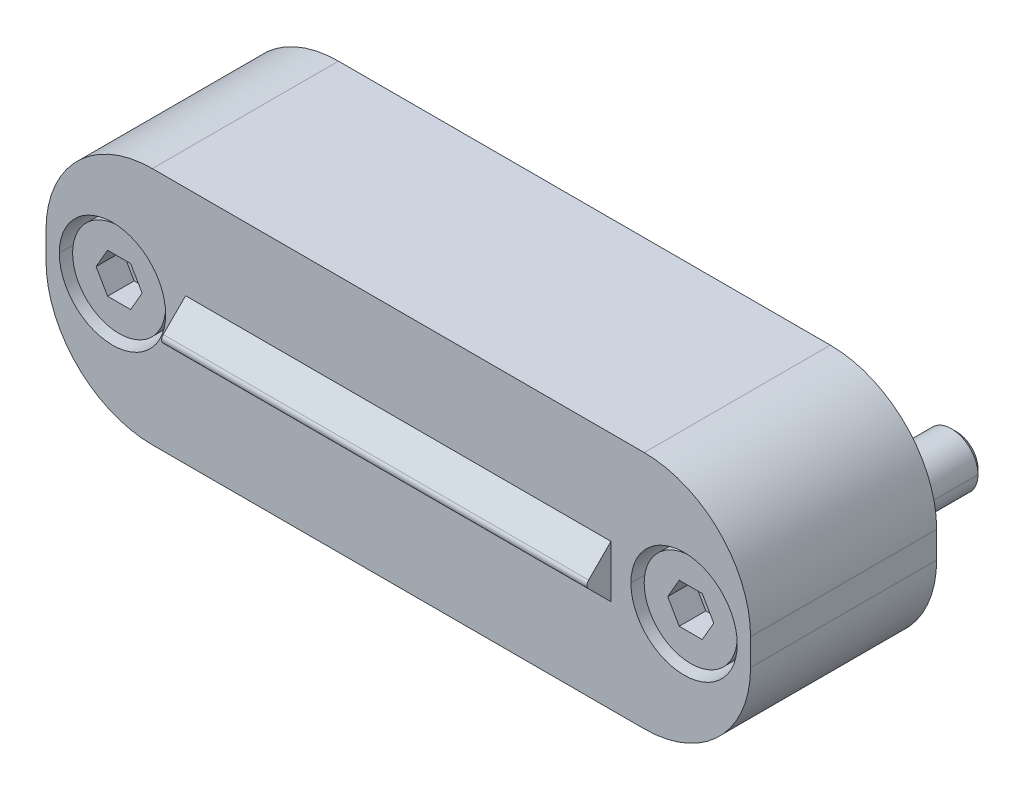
ISO-10303-21;
HEADER;
FILE_DESCRIPTION(('STEP AP214'),'2;1');
FILE_NAME('part.step','',(''),(''),'','','');
FILE_SCHEMA(('AUTOMOTIVE_DESIGN { 1 0 10303 214 1 1 1 1 }'));
ENDSEC;
DATA;
#1=APPLICATION_CONTEXT('core data for automotive mechanical design processes');
#2=APPLICATION_PROTOCOL_DEFINITION('international standard','automotive_design',2000,#1);
#3=PRODUCT_CONTEXT('',#1,'mechanical');
#4=PRODUCT('Part','Part','',(#3));
#5=PRODUCT_RELATED_PRODUCT_CATEGORY('part','',(#4));
#6=PRODUCT_DEFINITION_FORMATION('','',#4);
#7=PRODUCT_DEFINITION_CONTEXT('part definition',#1,'design');
#8=PRODUCT_DEFINITION('design','',#6,#7);
#9=PRODUCT_DEFINITION_SHAPE('','',#8);
#10=(LENGTH_UNIT() NAMED_UNIT(*) SI_UNIT(.MILLI.,.METRE.));
#11=(NAMED_UNIT(*) PLANE_ANGLE_UNIT() SI_UNIT($,.RADIAN.));
#12=(NAMED_UNIT(*) SI_UNIT($,.STERADIAN.) SOLID_ANGLE_UNIT());
#13=UNCERTAINTY_MEASURE_WITH_UNIT(LENGTH_MEASURE(1.E-05),#10,'distance_accuracy_value','');
#14=(GEOMETRIC_REPRESENTATION_CONTEXT(3) GLOBAL_UNCERTAINTY_ASSIGNED_CONTEXT((#13)) GLOBAL_UNIT_ASSIGNED_CONTEXT((#10,
#11,#12)) REPRESENTATION_CONTEXT('',''));
#15=CARTESIAN_POINT('',(0.,0.,0.));
#16=DIRECTION('',(0.,0.,1.));
#17=DIRECTION('',(1.,0.,0.));
#18=AXIS2_PLACEMENT_3D('',#15,#16,#17);
#19=CARTESIAN_POINT('',(21.5,0.,9.5));
#20=DIRECTION('',(0.,0.,-1.));
#21=DIRECTION('',(0.,1.,0.));
#22=AXIS2_PLACEMENT_3D('',#19,#20,#21);
#23=CYLINDRICAL_SURFACE('',#22,3.5);
#24=CARTESIAN_POINT('',(21.5,0.,13.5));
#25=DIRECTION('',(0.,0.,-1.));
#26=DIRECTION('',(0.,1.,0.));
#27=AXIS2_PLACEMENT_3D('',#24,#25,#26);
#28=CIRCLE('',#27,3.5);
#29=CARTESIAN_POINT('',(21.5,3.5,13.5));
#30=VERTEX_POINT('',#29);
#31=CARTESIAN_POINT('',(21.5,-3.5,13.5));
#32=VERTEX_POINT('',#31);
#33=EDGE_CURVE('P0_E10',#30,#32,#28,.T.);
#34=ORIENTED_EDGE('',*,*,#33,.T.);
#35=DIRECTION('',(0.,0.,-1.));
#36=VECTOR('',#35,1.);
#37=CARTESIAN_POINT('',(21.5,-3.5,9.5));
#38=LINE('',#37,#36);
#39=CARTESIAN_POINT('',(21.5,-3.5,9.5));
#40=VERTEX_POINT('',#39);
#41=EDGE_CURVE('P0_E27',#32,#40,#38,.T.);
#42=ORIENTED_EDGE('',*,*,#41,.T.);
#43=CARTESIAN_POINT('',(21.5,0.,9.5));
#44=DIRECTION('',(0.,0.,-1.));
#45=DIRECTION('',(0.,1.,0.));
#46=AXIS2_PLACEMENT_3D('',#43,#44,#45);
#47=CIRCLE('',#46,3.5);
#48=CARTESIAN_POINT('',(21.5,3.5,9.5));
#49=VERTEX_POINT('',#48);
#50=EDGE_CURVE('P0_E78',#49,#40,#47,.T.);
#51=ORIENTED_EDGE('',*,*,#50,.F.);
#52=DIRECTION('',(0.,0.,-1.));
#53=VECTOR('',#52,1.);
#54=CARTESIAN_POINT('',(21.5,3.5,9.5));
#55=LINE('',#54,#53);
#56=EDGE_CURVE('P0_E80',#30,#49,#55,.T.);
#57=ORIENTED_EDGE('',*,*,#56,.F.);
#58=EDGE_LOOP('',(#34,#42,#51,#57));
#59=FACE_BOUND('',#58,.T.);
#60=ADVANCED_FACE('P0_F16',(#59),#23,.T.);
#61=CARTESIAN_POINT('',(21.5,0.,13.5));
#62=DIRECTION('',(0.,0.,-1.));
#63=DIRECTION('',(0.,1.,0.));
#64=AXIS2_PLACEMENT_3D('',#61,#62,#63);
#65=PLANE('',#64);
#66=ORIENTED_EDGE('',*,*,#33,.F.);
#67=CARTESIAN_POINT('',(21.5,0.,13.5));
#68=DIRECTION('',(0.,0.,-1.));
#69=DIRECTION('',(0.,1.,0.));
#70=AXIS2_PLACEMENT_3D('',#67,#68,#69);
#71=CIRCLE('',#70,3.5);
#72=EDGE_CURVE('P0_E89',#32,#30,#71,.T.);
#73=ORIENTED_EDGE('',*,*,#72,.F.);
#74=EDGE_LOOP('',(#66,#73));
#75=FACE_BOUND('',#74,.T.);
#76=DIRECTION('',(-0.49999982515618,0.866025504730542,0.));
#77=VECTOR('',#76,1.);
#78=CARTESIAN_POINT('',(22.7990378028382,0.749999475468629,13.5));
#79=LINE('',#78,#77);
#80=CARTESIAN_POINT('',(23.23205,0.,13.5));
#81=VERTEX_POINT('',#80);
#82=CARTESIAN_POINT('',(22.366025,1.5,13.5));
#83=VERTEX_POINT('',#82);
#84=EDGE_CURVE('P0_E94',#81,#83,#79,.T.);
#85=ORIENTED_EDGE('',*,*,#84,.F.);
#86=DIRECTION('',(0.499999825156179,0.866025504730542,0.));
#87=VECTOR('',#86,1.);
#88=CARTESIAN_POINT('',(22.7990378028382,-0.749999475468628,13.5));
#89=LINE('',#88,#87);
#90=CARTESIAN_POINT('',(22.366025,-1.5,13.5));
#91=VERTEX_POINT('',#90);
#92=EDGE_CURVE('P0_E109',#91,#81,#89,.T.);
#93=ORIENTED_EDGE('',*,*,#92,.F.);
#94=DIRECTION('',(1.,0.,0.));
#95=VECTOR('',#94,1.);
#96=CARTESIAN_POINT('',(21.5,-1.5,13.5));
#97=LINE('',#96,#95);
#98=CARTESIAN_POINT('',(20.633975,-1.5,13.5));
#99=VERTEX_POINT('',#98);
#100=EDGE_CURVE('P0_E143',#99,#91,#97,.T.);
#101=ORIENTED_EDGE('',*,*,#100,.F.);
#102=DIRECTION('',(0.499999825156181,-0.866025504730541,0.));
#103=VECTOR('',#102,1.);
#104=CARTESIAN_POINT('',(20.2009621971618,-0.749999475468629,13.5));
#105=LINE('',#104,#103);
#106=CARTESIAN_POINT('',(19.76795,0.,13.5));
#107=VERTEX_POINT('',#106);
#108=EDGE_CURVE('P0_E147',#107,#99,#105,.T.);
#109=ORIENTED_EDGE('',*,*,#108,.F.);
#110=DIRECTION('',(-0.499999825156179,-0.866025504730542,0.));
#111=VECTOR('',#110,1.);
#112=CARTESIAN_POINT('',(20.2009621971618,0.749999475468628,13.5));
#113=LINE('',#112,#111);
#114=CARTESIAN_POINT('',(20.6339743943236,1.49999895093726,13.5));
#115=VERTEX_POINT('',#114);
#116=EDGE_CURVE('P0_E115',#115,#107,#113,.T.);
#117=ORIENTED_EDGE('',*,*,#116,.F.);
#118=DIRECTION('',(-0.999999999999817,-6.05676729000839E-07,0.));
#119=VECTOR('',#118,1.);
#120=CARTESIAN_POINT('',(21.4999990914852,1.49999947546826,13.5));
#121=LINE('',#120,#119);
#122=EDGE_CURVE('P0_E133',#83,#115,#121,.T.);
#123=ORIENTED_EDGE('',*,*,#122,.F.);
#124=EDGE_LOOP('',(#85,#93,#101,#109,#117,#123));
#125=FACE_BOUND('',#124,.T.);
#126=ADVANCED_FACE('P0_F187',(#75,#125),#65,.F.);
#127=CARTESIAN_POINT('',(21.5,0.,9.5));
#128=DIRECTION('',(0.,0.,-1.));
#129=DIRECTION('',(0.,1.,0.));
#130=AXIS2_PLACEMENT_3D('',#127,#128,#129);
#131=CYLINDRICAL_SURFACE('',#130,3.5);
#132=ORIENTED_EDGE('',*,*,#41,.F.);
#133=ORIENTED_EDGE('',*,*,#72,.T.);
#134=ORIENTED_EDGE('',*,*,#56,.T.);
#135=CARTESIAN_POINT('',(21.5,0.,9.5));
#136=DIRECTION('',(0.,0.,-1.));
#137=DIRECTION('',(0.,1.,0.));
#138=AXIS2_PLACEMENT_3D('',#135,#136,#137);
#139=CIRCLE('',#138,3.5);
#140=EDGE_CURVE('P0_E85',#40,#49,#139,.T.);
#141=ORIENTED_EDGE('',*,*,#140,.F.);
#142=EDGE_LOOP('',(#132,#133,#134,#141));
#143=FACE_BOUND('',#142,.T.);
#144=ADVANCED_FACE('P0_F87',(#143),#131,.T.);
#145=CARTESIAN_POINT('',(25.,0.,9.5));
#146=DIRECTION('',(0.,0.,1.));
#147=DIRECTION('',(1.,0.,0.));
#148=AXIS2_PLACEMENT_3D('',#145,#146,#147);
#149=PLANE('',#148);
#150=ORIENTED_EDGE('',*,*,#50,.T.);
#151=ORIENTED_EDGE('',*,*,#140,.T.);
#152=EDGE_LOOP('',(#150,#151));
#153=FACE_BOUND('',#152,.T.);
#154=ADVANCED_FACE('P0_F92',(#153),#149,.F.);
#155=CARTESIAN_POINT('',(22.366025,1.5,11.4999999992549));
#156=DIRECTION('',(-0.866025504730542,-0.49999982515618,0.));
#157=DIRECTION('',(0.,0.,1.));
#158=AXIS2_PLACEMENT_3D('',#155,#156,#157);
#159=PLANE('',#158);
#160=ORIENTED_EDGE('',*,*,#84,.T.);
#161=DIRECTION('',(0.,0.,1.));
#162=VECTOR('',#161,1.);
#163=CARTESIAN_POINT('',(22.366025,1.5,11.4999999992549));
#164=LINE('',#163,#162);
#165=CARTESIAN_POINT('',(22.366025,1.5,11.4999999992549));
#166=VERTEX_POINT('',#165);
#167=EDGE_CURVE('P0_E123',#166,#83,#164,.T.);
#168=ORIENTED_EDGE('',*,*,#167,.F.);
#169=DIRECTION('',(0.49999982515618,-0.866025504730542,0.));
#170=VECTOR('',#169,1.);
#171=CARTESIAN_POINT('',(22.366025,1.5,11.4999999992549));
#172=LINE('',#171,#170);
#173=CARTESIAN_POINT('',(23.23205,0.,11.4999999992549));
#174=VERTEX_POINT('',#173);
#175=EDGE_CURVE('P0_E101',#166,#174,#172,.T.);
#176=ORIENTED_EDGE('',*,*,#175,.T.);
#177=DIRECTION('',(0.,0.,1.));
#178=VECTOR('',#177,1.);
#179=CARTESIAN_POINT('',(23.23205,0.,11.4999999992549));
#180=LINE('',#179,#178);
#181=EDGE_CURVE('P0_E20',#174,#81,#180,.T.);
#182=ORIENTED_EDGE('',*,*,#181,.T.);
#183=EDGE_LOOP('',(#160,#168,#176,#182));
#184=FACE_BOUND('',#183,.T.);
#185=ADVANCED_FACE('P0_F299',(#184),#159,.T.);
#186=CARTESIAN_POINT('',(23.23205,0.,11.4999999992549));
#187=DIRECTION('',(-0.866025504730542,0.499999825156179,0.));
#188=DIRECTION('',(-0.499999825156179,-0.866025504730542,0.));
#189=AXIS2_PLACEMENT_3D('',#186,#187,#188);
#190=PLANE('',#189);
#191=ORIENTED_EDGE('',*,*,#92,.T.);
#192=ORIENTED_EDGE('',*,*,#181,.F.);
#193=DIRECTION('',(-0.499999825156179,-0.866025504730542,0.));
#194=VECTOR('',#193,1.);
#195=CARTESIAN_POINT('',(23.23205,0.,11.4999999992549));
#196=LINE('',#195,#194);
#197=CARTESIAN_POINT('',(22.366025,-1.5,11.4999999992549));
#198=VERTEX_POINT('',#197);
#199=EDGE_CURVE('P0_E105',#174,#198,#196,.T.);
#200=ORIENTED_EDGE('',*,*,#199,.T.);
#201=DIRECTION('',(0.,0.,1.));
#202=VECTOR('',#201,1.);
#203=CARTESIAN_POINT('',(22.366025,-1.5,11.4999999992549));
#204=LINE('',#203,#202);
#205=EDGE_CURVE('P0_E110',#198,#91,#204,.T.);
#206=ORIENTED_EDGE('',*,*,#205,.T.);
#207=EDGE_LOOP('',(#191,#192,#200,#206));
#208=FACE_BOUND('',#207,.T.);
#209=ADVANCED_FACE('P0_F303',(#208),#190,.T.);
#210=CARTESIAN_POINT('',(22.366025,-1.5,11.4999999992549));
#211=DIRECTION('',(0.,1.,0.));
#212=DIRECTION('',(-1.,0.,0.));
#213=AXIS2_PLACEMENT_3D('',#210,#211,#212);
#214=PLANE('',#213);
#215=ORIENTED_EDGE('',*,*,#100,.T.);
#216=ORIENTED_EDGE('',*,*,#205,.F.);
#217=DIRECTION('',(-1.,0.,0.));
#218=VECTOR('',#217,1.);
#219=CARTESIAN_POINT('',(22.366025,-1.5,11.4999999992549));
#220=LINE('',#219,#218);
#221=CARTESIAN_POINT('',(20.633975,-1.5,11.4999999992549));
#222=VERTEX_POINT('',#221);
#223=EDGE_CURVE('P0_E167',#198,#222,#220,.T.);
#224=ORIENTED_EDGE('',*,*,#223,.T.);
#225=DIRECTION('',(0.,0.,1.));
#226=VECTOR('',#225,1.);
#227=CARTESIAN_POINT('',(20.633975,-1.5,11.4999999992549));
#228=LINE('',#227,#226);
#229=EDGE_CURVE('P0_E149',#222,#99,#228,.T.);
#230=ORIENTED_EDGE('',*,*,#229,.T.);
#231=EDGE_LOOP('',(#215,#216,#224,#230));
#232=FACE_BOUND('',#231,.T.);
#233=ADVANCED_FACE('P0_F341',(#232),#214,.T.);
#234=CARTESIAN_POINT('',(20.633975,-1.5,11.4999999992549));
#235=DIRECTION('',(0.866025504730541,0.499999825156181,0.));
#236=DIRECTION('',(0.,0.,-1.));
#237=AXIS2_PLACEMENT_3D('',#234,#235,#236);
#238=PLANE('',#237);
#239=ORIENTED_EDGE('',*,*,#108,.T.);
#240=ORIENTED_EDGE('',*,*,#229,.F.);
#241=DIRECTION('',(-0.499999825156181,0.866025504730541,0.));
#242=VECTOR('',#241,1.);
#243=CARTESIAN_POINT('',(20.633975,-1.5,11.4999999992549));
#244=LINE('',#243,#242);
#245=CARTESIAN_POINT('',(19.76795,0.,11.4999999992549));
#246=VERTEX_POINT('',#245);
#247=EDGE_CURVE('P0_E150',#222,#246,#244,.T.);
#248=ORIENTED_EDGE('',*,*,#247,.T.);
#249=DIRECTION('',(0.,0.,1.));
#250=VECTOR('',#249,1.);
#251=CARTESIAN_POINT('',(19.76795,0.,11.4999999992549));
#252=LINE('',#251,#250);
#253=EDGE_CURVE('P0_E119',#246,#107,#252,.T.);
#254=ORIENTED_EDGE('',*,*,#253,.T.);
#255=EDGE_LOOP('',(#239,#240,#248,#254));
#256=FACE_BOUND('',#255,.T.);
#257=ADVANCED_FACE('P0_F193',(#256),#238,.T.);
#258=CARTESIAN_POINT('',(19.76795,0.,11.4999999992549));
#259=DIRECTION('',(0.866025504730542,-0.499999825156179,0.));
#260=DIRECTION('',(0.,0.,-1.));
#261=AXIS2_PLACEMENT_3D('',#258,#259,#260);
#262=PLANE('',#261);
#263=ORIENTED_EDGE('',*,*,#116,.T.);
#264=ORIENTED_EDGE('',*,*,#253,.F.);
#265=DIRECTION('',(0.499999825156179,0.866025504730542,0.));
#266=VECTOR('',#265,1.);
#267=CARTESIAN_POINT('',(19.76795,0.,11.4999999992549));
#268=LINE('',#267,#266);
#269=CARTESIAN_POINT('',(20.6339743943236,1.49999895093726,11.4999999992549));
#270=VERTEX_POINT('',#269);
#271=EDGE_CURVE('P0_E120',#246,#270,#268,.T.);
#272=ORIENTED_EDGE('',*,*,#271,.T.);
#273=DIRECTION('',(0.,0.,1.));
#274=VECTOR('',#273,1.);
#275=CARTESIAN_POINT('',(20.6339743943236,1.49999895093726,11.4999999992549));
#276=LINE('',#275,#274);
#277=EDGE_CURVE('P0_E139',#270,#115,#276,.T.);
#278=ORIENTED_EDGE('',*,*,#277,.T.);
#279=EDGE_LOOP('',(#263,#264,#272,#278));
#280=FACE_BOUND('',#279,.T.);
#281=ADVANCED_FACE('P0_F176',(#280),#262,.T.);
#282=CARTESIAN_POINT('',(20.6339743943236,1.49999895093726,11.4999999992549));
#283=DIRECTION('',(6.05676729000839E-07,-0.999999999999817,0.));
#284=DIRECTION('',(0.,0.,-1.));
#285=AXIS2_PLACEMENT_3D('',#282,#283,#284);
#286=PLANE('',#285);
#287=ORIENTED_EDGE('',*,*,#122,.T.);
#288=ORIENTED_EDGE('',*,*,#277,.F.);
#289=DIRECTION('',(0.999999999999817,6.05676729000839E-07,0.));
#290=VECTOR('',#289,1.);
#291=CARTESIAN_POINT('',(20.6339743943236,1.49999895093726,11.4999999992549));
#292=LINE('',#291,#290);
#293=EDGE_CURVE('P0_E126',#270,#166,#292,.T.);
#294=ORIENTED_EDGE('',*,*,#293,.T.);
#295=ORIENTED_EDGE('',*,*,#167,.T.);
#296=EDGE_LOOP('',(#287,#288,#294,#295));
#297=FACE_BOUND('',#296,.T.);
#298=ADVANCED_FACE('P0_F183',(#297),#286,.T.);
#299=CARTESIAN_POINT('',(21.5,0.,11.4999999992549));
#300=DIRECTION('',(0.,0.,1.));
#301=DIRECTION('',(1.,0.,0.));
#302=AXIS2_PLACEMENT_3D('',#299,#300,#301);
#303=PLANE('',#302);
#304=ORIENTED_EDGE('',*,*,#175,.F.);
#305=ORIENTED_EDGE('',*,*,#293,.F.);
#306=ORIENTED_EDGE('',*,*,#271,.F.);
#307=ORIENTED_EDGE('',*,*,#247,.F.);
#308=ORIENTED_EDGE('',*,*,#223,.F.);
#309=ORIENTED_EDGE('',*,*,#199,.F.);
#310=EDGE_LOOP('',(#304,#305,#306,#307,#308,#309));
#311=FACE_BOUND('',#310,.T.);
#312=ADVANCED_FACE('P0_F18',(#311),#303,.T.);
#313=CLOSED_SHELL('',(#60,#126,#144,#154,#185,#209,#233,#257,#281,#298,#312));
#314=MANIFOLD_SOLID_BREP('P0_B1',#313);
#315=CARTESIAN_POINT('',(21.5000000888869,0.,-6.11000000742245));
#316=DIRECTION('',(-6.08397622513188E-09,0.,1.));
#317=DIRECTION('',(-1.,0.,-6.08397622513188E-09));
#318=AXIS2_PLACEMENT_3D('',#315,#316,#317);
#319=CONICAL_SURFACE('',#318,1.99999999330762,0.785398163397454);
#320=CARTESIAN_POINT('',(21.5000000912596,0.,-6.5000000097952));
#321=DIRECTION('',(-6.08397695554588E-09,0.,1.));
#322=DIRECTION('',(-1.,0.,-6.08397695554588E-09));
#323=AXIS2_PLACEMENT_3D('',#320,#321,#322);
#324=CIRCLE('',#323,1.60999999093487);
#325=CARTESIAN_POINT('',(19.8900001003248,0.,-6.5000000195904));
#326=VERTEX_POINT('',#325);
#327=CARTESIAN_POINT('',(23.1100000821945,0.,-6.5));
#328=VERTEX_POINT('',#327);
#329=EDGE_CURVE('P1_E11',#326,#328,#324,.T.);
#330=ORIENTED_EDGE('',*,*,#329,.T.);
#331=DIRECTION('',(0.707106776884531,0.,0.707106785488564));
#332=VECTOR('',#331,1.);
#333=CARTESIAN_POINT('',(23.5000000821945,0.,-6.1099999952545));
#334=LINE('',#333,#332);
#335=CARTESIAN_POINT('',(23.5000000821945,0.,-6.1099999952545));
#336=VERTEX_POINT('',#335);
#337=EDGE_CURVE('P1_E28',#328,#336,#334,.T.);
#338=ORIENTED_EDGE('',*,*,#337,.T.);
#339=CARTESIAN_POINT('',(21.5000000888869,0.,-6.11000000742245));
#340=DIRECTION('',(-6.08397622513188E-09,0.,1.));
#341=DIRECTION('',(-1.,0.,-6.08397622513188E-09));
#342=AXIS2_PLACEMENT_3D('',#339,#340,#341);
#343=CIRCLE('',#342,1.99999999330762);
#344=CARTESIAN_POINT('',(19.5000000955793,0.,-6.1100000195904));
#345=VERTEX_POINT('',#344);
#346=EDGE_CURVE('P1_E21',#345,#336,#343,.T.);
#347=ORIENTED_EDGE('',*,*,#346,.F.);
#348=DIRECTION('',(-0.707106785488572,0.,0.707106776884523));
#349=VECTOR('',#348,1.);
#350=CARTESIAN_POINT('',(19.5000000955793,0.,-6.1100000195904));
#351=LINE('',#350,#349);
#352=EDGE_CURVE('P1_E72',#326,#345,#351,.T.);
#353=ORIENTED_EDGE('',*,*,#352,.F.);
#354=EDGE_LOOP('',(#330,#338,#347,#353));
#355=FACE_BOUND('',#354,.T.);
#356=ADVANCED_FACE('P1_F17',(#355),#319,.T.);
#357=CARTESIAN_POINT('',(21.5,0.,8.5));
#358=DIRECTION('',(-6.08397587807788E-09,0.,1.));
#359=DIRECTION('',(-1.,0.,-6.08397587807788E-09));
#360=AXIS2_PLACEMENT_3D('',#357,#358,#359);
#361=CYLINDRICAL_SURFACE('',#360,1.60999999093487);
#362=CARTESIAN_POINT('',(21.5000000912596,0.,-6.5000000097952));
#363=DIRECTION('',(-6.08397695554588E-09,0.,1.));
#364=DIRECTION('',(-1.,0.,-6.08397695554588E-09));
#365=AXIS2_PLACEMENT_3D('',#362,#363,#364);
#366=CIRCLE('',#365,1.60999999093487);
#367=EDGE_CURVE('P1_E42',#328,#326,#366,.T.);
#368=ORIENTED_EDGE('',*,*,#367,.F.);
#369=DIRECTION('',(-6.08397588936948E-09,0.,1.));
#370=VECTOR('',#369,1.);
#371=CARTESIAN_POINT('',(23.1099999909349,0.,8.50000000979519));
#372=LINE('',#371,#370);
#373=CARTESIAN_POINT('',(23.1099999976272,0.,7.39999999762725));
#374=VERTEX_POINT('',#373);
#375=EDGE_CURVE('P1_E92',#328,#374,#372,.T.);
#376=ORIENTED_EDGE('',*,*,#375,.T.);
#377=CARTESIAN_POINT('',(21.5000000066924,0.,7.39999998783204));
#378=DIRECTION('',(-6.08397587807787E-09,0.,1.));
#379=DIRECTION('',(-1.,0.,-6.08397587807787E-09));
#380=AXIS2_PLACEMENT_3D('',#377,#378,#379);
#381=CIRCLE('',#380,1.60999999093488);
#382=CARTESIAN_POINT('',(19.8900000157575,0.,7.39999997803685));
#383=VERTEX_POINT('',#382);
#384=EDGE_CURVE('P1_E94',#374,#383,#381,.T.);
#385=ORIENTED_EDGE('',*,*,#384,.T.);
#386=DIRECTION('',(-6.08397588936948E-09,0.,1.));
#387=VECTOR('',#386,1.);
#388=CARTESIAN_POINT('',(19.8900000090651,0.,8.49999999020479));
#389=LINE('',#388,#387);
#390=EDGE_CURVE('P1_E90',#326,#383,#389,.T.);
#391=ORIENTED_EDGE('',*,*,#390,.F.);
#392=EDGE_LOOP('',(#368,#376,#385,#391));
#393=FACE_BOUND('',#392,.T.);
#394=ADVANCED_FACE('P1_F93',(#393),#361,.F.);
#395=CARTESIAN_POINT('',(21.5,0.,8.5));
#396=DIRECTION('',(-6.08397589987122E-09,0.,1.));
#397=DIRECTION('',(-1.,0.,-6.08397589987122E-09));
#398=AXIS2_PLACEMENT_3D('',#395,#396,#397);
#399=CYLINDRICAL_SURFACE('',#398,1.99999999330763);
#400=ORIENTED_EDGE('',*,*,#346,.T.);
#401=DIRECTION('',(-6.08397588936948E-09,0.,1.));
#402=VECTOR('',#401,1.);
#403=CARTESIAN_POINT('',(23.4999999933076,0.,8.50000001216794));
#404=LINE('',#403,#402);
#405=CARTESIAN_POINT('',(23.5,0.,7.4));
#406=VERTEX_POINT('',#405);
#407=EDGE_CURVE('P1_E110',#336,#406,#404,.T.);
#408=ORIENTED_EDGE('',*,*,#407,.T.);
#409=CARTESIAN_POINT('',(21.5000000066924,0.,7.39999998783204));
#410=DIRECTION('',(-6.08397579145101E-09,0.,1.));
#411=DIRECTION('',(-1.,0.,-6.08397579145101E-09));
#412=AXIS2_PLACEMENT_3D('',#409,#410,#411);
#413=CIRCLE('',#412,1.99999999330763);
#414=CARTESIAN_POINT('',(19.5000000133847,0.,7.39999997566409));
#415=VERTEX_POINT('',#414);
#416=EDGE_CURVE('P1_E105',#415,#406,#413,.T.);
#417=ORIENTED_EDGE('',*,*,#416,.F.);
#418=DIRECTION('',(-6.08397588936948E-09,0.,1.));
#419=VECTOR('',#418,1.);
#420=CARTESIAN_POINT('',(19.5000000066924,0.,8.49999998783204));
#421=LINE('',#420,#419);
#422=EDGE_CURVE('P1_E111',#345,#415,#421,.T.);
#423=ORIENTED_EDGE('',*,*,#422,.F.);
#424=EDGE_LOOP('',(#400,#408,#417,#423));
#425=FACE_BOUND('',#424,.T.);
#426=ADVANCED_FACE('P1_F131',(#425),#399,.T.);
#427=CARTESIAN_POINT('',(21.5,0.,8.5));
#428=DIRECTION('',(-6.08397589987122E-09,0.,1.));
#429=DIRECTION('',(-1.,0.,-6.08397589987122E-09));
#430=AXIS2_PLACEMENT_3D('',#427,#428,#429);
#431=CYLINDRICAL_SURFACE('',#430,1.99999999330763);
#432=ORIENTED_EDGE('',*,*,#407,.F.);
#433=CARTESIAN_POINT('',(21.5000000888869,0.,-6.11000000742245));
#434=DIRECTION('',(-6.08397622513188E-09,0.,1.));
#435=DIRECTION('',(-1.,0.,-6.08397622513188E-09));
#436=AXIS2_PLACEMENT_3D('',#433,#434,#435);
#437=CIRCLE('',#436,1.99999999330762);
#438=EDGE_CURVE('P1_E108',#336,#345,#437,.T.);
#439=ORIENTED_EDGE('',*,*,#438,.T.);
#440=ORIENTED_EDGE('',*,*,#422,.T.);
#441=CARTESIAN_POINT('',(21.5000000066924,0.,7.39999998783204));
#442=DIRECTION('',(-6.08397579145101E-09,0.,1.));
#443=DIRECTION('',(-1.,0.,-6.08397579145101E-09));
#444=AXIS2_PLACEMENT_3D('',#441,#442,#443);
#445=CIRCLE('',#444,1.99999999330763);
#446=EDGE_CURVE('P1_E97',#406,#415,#445,.T.);
#447=ORIENTED_EDGE('',*,*,#446,.F.);
#448=EDGE_LOOP('',(#432,#439,#440,#447));
#449=FACE_BOUND('',#448,.T.);
#450=ADVANCED_FACE('P1_F19',(#449),#431,.T.);
#451=CARTESIAN_POINT('',(23.1099999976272,0.,7.39999999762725));
#452=DIRECTION('',(-6.08397588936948E-09,0.,1.));
#453=DIRECTION('',(0.,-1.,0.));
#454=AXIS2_PLACEMENT_3D('',#451,#452,#453);
#455=PLANE('',#454);
#456=ORIENTED_EDGE('',*,*,#416,.T.);
#457=ORIENTED_EDGE('',*,*,#446,.T.);
#458=EDGE_LOOP('',(#456,#457));
#459=FACE_BOUND('',#458,.T.);
#460=CARTESIAN_POINT('',(21.5000000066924,0.,7.39999998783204));
#461=DIRECTION('',(-6.08397587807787E-09,0.,1.));
#462=DIRECTION('',(-1.,0.,-6.08397587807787E-09));
#463=AXIS2_PLACEMENT_3D('',#460,#461,#462);
#464=CIRCLE('',#463,1.60999999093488);
#465=EDGE_CURVE('P1_E85',#383,#374,#464,.T.);
#466=ORIENTED_EDGE('',*,*,#465,.F.);
#467=ORIENTED_EDGE('',*,*,#384,.F.);
#468=EDGE_LOOP('',(#466,#467));
#469=FACE_BOUND('',#468,.T.);
#470=ADVANCED_FACE('P1_F206',(#459,#469),#455,.T.);
#471=CARTESIAN_POINT('',(21.5,0.,8.5));
#472=DIRECTION('',(-6.08397587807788E-09,0.,1.));
#473=DIRECTION('',(-1.,0.,-6.08397587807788E-09));
#474=AXIS2_PLACEMENT_3D('',#471,#472,#473);
#475=CYLINDRICAL_SURFACE('',#474,1.60999999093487);
#476=ORIENTED_EDGE('',*,*,#375,.F.);
#477=ORIENTED_EDGE('',*,*,#329,.F.);
#478=ORIENTED_EDGE('',*,*,#390,.T.);
#479=ORIENTED_EDGE('',*,*,#465,.T.);
#480=EDGE_LOOP('',(#476,#477,#478,#479));
#481=FACE_BOUND('',#480,.T.);
#482=ADVANCED_FACE('P1_F88',(#481),#475,.F.);
#483=CARTESIAN_POINT('',(21.5000000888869,0.,-6.11000000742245));
#484=DIRECTION('',(-6.08397622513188E-09,0.,1.));
#485=DIRECTION('',(-1.,0.,-6.08397622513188E-09));
#486=AXIS2_PLACEMENT_3D('',#483,#484,#485);
#487=CONICAL_SURFACE('',#486,1.99999999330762,0.785398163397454);
#488=ORIENTED_EDGE('',*,*,#337,.F.);
#489=ORIENTED_EDGE('',*,*,#367,.T.);
#490=ORIENTED_EDGE('',*,*,#352,.T.);
#491=ORIENTED_EDGE('',*,*,#438,.F.);
#492=EDGE_LOOP('',(#488,#489,#490,#491));
#493=FACE_BOUND('',#492,.T.);
#494=ADVANCED_FACE('P1_F83',(#493),#487,.T.);
#495=CLOSED_SHELL('',(#356,#394,#426,#450,#470,#482,#494));
#496=MANIFOLD_SOLID_BREP('P1_B1',#495);
#497=CARTESIAN_POINT('',(21.5,0.,-6.5));
#498=DIRECTION('',(0.,0.,-1.));
#499=DIRECTION('',(0.,1.,0.));
#500=AXIS2_PLACEMENT_3D('',#497,#498,#499);
#501=CYLINDRICAL_SURFACE('',#500,1.61);
#502=CARTESIAN_POINT('',(21.5,0.,7.4));
#503=DIRECTION('',(0.,0.,-1.));
#504=DIRECTION('',(0.,1.,0.));
#505=AXIS2_PLACEMENT_3D('',#502,#503,#504);
#506=CIRCLE('',#505,1.61);
#507=CARTESIAN_POINT('',(21.5,1.61,7.4));
#508=VERTEX_POINT('',#507);
#509=CARTESIAN_POINT('',(21.5,-1.61,7.4));
#510=VERTEX_POINT('',#509);
#511=EDGE_CURVE('P2_E11',#508,#510,#506,.T.);
#512=ORIENTED_EDGE('',*,*,#511,.T.);
#513=DIRECTION('',(0.,0.,-1.));
#514=VECTOR('',#513,1.);
#515=CARTESIAN_POINT('',(21.5,-1.61,-6.5));
#516=LINE('',#515,#514);
#517=CARTESIAN_POINT('',(21.5,-1.61,-6.5));
#518=VERTEX_POINT('',#517);
#519=EDGE_CURVE('P2_E28',#510,#518,#516,.T.);
#520=ORIENTED_EDGE('',*,*,#519,.T.);
#521=CARTESIAN_POINT('',(21.5,0.,-6.5));
#522=DIRECTION('',(0.,0.,-1.));
#523=DIRECTION('',(0.,1.,0.));
#524=AXIS2_PLACEMENT_3D('',#521,#522,#523);
#525=CIRCLE('',#524,1.61);
#526=CARTESIAN_POINT('',(21.5,1.61,-6.5));
#527=VERTEX_POINT('',#526);
#528=EDGE_CURVE('P2_E82',#527,#518,#525,.T.);
#529=ORIENTED_EDGE('',*,*,#528,.F.);
#530=DIRECTION('',(0.,0.,-1.));
#531=VECTOR('',#530,1.);
#532=CARTESIAN_POINT('',(21.5,1.61,-6.5));
#533=LINE('',#532,#531);
#534=EDGE_CURVE('P2_E79',#508,#527,#533,.T.);
#535=ORIENTED_EDGE('',*,*,#534,.F.);
#536=EDGE_LOOP('',(#512,#520,#529,#535));
#537=FACE_BOUND('',#536,.T.);
#538=ADVANCED_FACE('P2_F17',(#537),#501,.T.);
#539=CARTESIAN_POINT('',(21.5,0.,-6.5));
#540=DIRECTION('',(0.,0.,-1.));
#541=DIRECTION('',(0.,1.,0.));
#542=AXIS2_PLACEMENT_3D('',#539,#540,#541);
#543=CYLINDRICAL_SURFACE('',#542,2.);
#544=CARTESIAN_POINT('',(21.5,0.,9.5));
#545=DIRECTION('',(0.,0.,-1.));
#546=DIRECTION('',(0.,1.,0.));
#547=AXIS2_PLACEMENT_3D('',#544,#545,#546);
#548=CIRCLE('',#547,2.);
#549=CARTESIAN_POINT('',(21.5,2.,9.5));
#550=VERTEX_POINT('',#549);
#551=CARTESIAN_POINT('',(21.5,-2.,9.5));
#552=VERTEX_POINT('',#551);
#553=EDGE_CURVE('P2_E103',#550,#552,#548,.T.);
#554=ORIENTED_EDGE('',*,*,#553,.T.);
#555=DIRECTION('',(0.,0.,-1.));
#556=VECTOR('',#555,1.);
#557=CARTESIAN_POINT('',(21.5,-2.,-6.5));
#558=LINE('',#557,#556);
#559=CARTESIAN_POINT('',(21.5,-2.,7.4));
#560=VERTEX_POINT('',#559);
#561=EDGE_CURVE('P2_E71',#552,#560,#558,.T.);
#562=ORIENTED_EDGE('',*,*,#561,.T.);
#563=CARTESIAN_POINT('',(21.5,0.,7.4));
#564=DIRECTION('',(0.,0.,-1.));
#565=DIRECTION('',(0.,1.,0.));
#566=AXIS2_PLACEMENT_3D('',#563,#564,#565);
#567=CIRCLE('',#566,2.);
#568=CARTESIAN_POINT('',(21.5,2.,7.4));
#569=VERTEX_POINT('',#568);
#570=EDGE_CURVE('P2_E21',#569,#560,#567,.T.);
#571=ORIENTED_EDGE('',*,*,#570,.F.);
#572=DIRECTION('',(0.,0.,-1.));
#573=VECTOR('',#572,1.);
#574=CARTESIAN_POINT('',(21.5,2.,-6.5));
#575=LINE('',#574,#573);
#576=EDGE_CURVE('P2_E114',#550,#569,#575,.T.);
#577=ORIENTED_EDGE('',*,*,#576,.F.);
#578=EDGE_LOOP('',(#554,#562,#571,#577));
#579=FACE_BOUND('',#578,.T.);
#580=ADVANCED_FACE('P2_F19',(#579),#543,.T.);
#581=CARTESIAN_POINT('',(21.5,0.,-6.5));
#582=DIRECTION('',(0.,0.,-1.));
#583=DIRECTION('',(0.,1.,0.));
#584=AXIS2_PLACEMENT_3D('',#581,#582,#583);
#585=CYLINDRICAL_SURFACE('',#584,2.);
#586=ORIENTED_EDGE('',*,*,#561,.F.);
#587=CARTESIAN_POINT('',(21.5,0.,9.5));
#588=DIRECTION('',(0.,0.,-1.));
#589=DIRECTION('',(0.,1.,0.));
#590=AXIS2_PLACEMENT_3D('',#587,#588,#589);
#591=CIRCLE('',#590,2.);
#592=EDGE_CURVE('P2_E101',#552,#550,#591,.T.);
#593=ORIENTED_EDGE('',*,*,#592,.T.);
#594=ORIENTED_EDGE('',*,*,#576,.T.);
#595=CARTESIAN_POINT('',(21.5,0.,7.4));
#596=DIRECTION('',(0.,0.,-1.));
#597=DIRECTION('',(0.,1.,0.));
#598=AXIS2_PLACEMENT_3D('',#595,#596,#597);
#599=CIRCLE('',#598,2.);
#600=EDGE_CURVE('P2_E91',#560,#569,#599,.T.);
#601=ORIENTED_EDGE('',*,*,#600,.F.);
#602=EDGE_LOOP('',(#586,#593,#594,#601));
#603=FACE_BOUND('',#602,.T.);
#604=ADVANCED_FACE('P2_F190',(#603),#585,.T.);
#605=CARTESIAN_POINT('',(23.5,0.,7.4));
#606=DIRECTION('',(0.,0.,1.));
#607=DIRECTION('',(1.,0.,0.));
#608=AXIS2_PLACEMENT_3D('',#605,#606,#607);
#609=PLANE('',#608);
#610=ORIENTED_EDGE('',*,*,#570,.T.);
#611=ORIENTED_EDGE('',*,*,#600,.T.);
#612=EDGE_LOOP('',(#610,#611));
#613=FACE_BOUND('',#612,.T.);
#614=ORIENTED_EDGE('',*,*,#511,.F.);
#615=CARTESIAN_POINT('',(21.5,0.,7.4));
#616=DIRECTION('',(0.,0.,-1.));
#617=DIRECTION('',(0.,1.,0.));
#618=AXIS2_PLACEMENT_3D('',#615,#616,#617);
#619=CIRCLE('',#618,1.61);
#620=EDGE_CURVE('P2_E85',#510,#508,#619,.T.);
#621=ORIENTED_EDGE('',*,*,#620,.F.);
#622=EDGE_LOOP('',(#614,#621));
#623=FACE_BOUND('',#622,.T.);
#624=ADVANCED_FACE('P2_F88',(#613,#623),#609,.F.);
#625=CARTESIAN_POINT('',(21.5,0.,-6.5));
#626=DIRECTION('',(0.,0.,-1.));
#627=DIRECTION('',(0.,1.,0.));
#628=AXIS2_PLACEMENT_3D('',#625,#626,#627);
#629=CYLINDRICAL_SURFACE('',#628,1.61);
#630=ORIENTED_EDGE('',*,*,#519,.F.);
#631=ORIENTED_EDGE('',*,*,#620,.T.);
#632=ORIENTED_EDGE('',*,*,#534,.T.);
#633=CARTESIAN_POINT('',(21.5,0.,-6.5));
#634=DIRECTION('',(0.,0.,-1.));
#635=DIRECTION('',(0.,1.,0.));
#636=AXIS2_PLACEMENT_3D('',#633,#634,#635);
#637=CIRCLE('',#636,1.61);
#638=EDGE_CURVE('P2_E105',#518,#527,#637,.T.);
#639=ORIENTED_EDGE('',*,*,#638,.F.);
#640=EDGE_LOOP('',(#630,#631,#632,#639));
#641=FACE_BOUND('',#640,.T.);
#642=ADVANCED_FACE('P2_F89',(#641),#629,.T.);
#643=CARTESIAN_POINT('',(23.11,0.,-6.5));
#644=DIRECTION('',(0.,0.,1.));
#645=DIRECTION('',(1.,0.,0.));
#646=AXIS2_PLACEMENT_3D('',#643,#644,#645);
#647=PLANE('',#646);
#648=ORIENTED_EDGE('',*,*,#528,.T.);
#649=ORIENTED_EDGE('',*,*,#638,.T.);
#650=EDGE_LOOP('',(#648,#649));
#651=FACE_BOUND('',#650,.T.);
#652=ADVANCED_FACE('P2_F212',(#651),#647,.F.);
#653=CARTESIAN_POINT('',(21.5,0.,9.5));
#654=DIRECTION('',(0.,0.,-1.));
#655=DIRECTION('',(0.,1.,0.));
#656=AXIS2_PLACEMENT_3D('',#653,#654,#655);
#657=PLANE('',#656);
#658=ORIENTED_EDGE('',*,*,#553,.F.);
#659=ORIENTED_EDGE('',*,*,#592,.F.);
#660=EDGE_LOOP('',(#658,#659));
#661=FACE_BOUND('',#660,.T.);
#662=ADVANCED_FACE('P2_F220',(#661),#657,.F.);
#663=CLOSED_SHELL('',(#538,#580,#604,#624,#642,#652,#662));
#664=MANIFOLD_SOLID_BREP('P2_B1',#663);
#665=CARTESIAN_POINT('',(-21.5,0.,9.5));
#666=DIRECTION('',(0.,0.,-1.));
#667=DIRECTION('',(0.,1.,0.));
#668=AXIS2_PLACEMENT_3D('',#665,#666,#667);
#669=CYLINDRICAL_SURFACE('',#668,3.5);
#670=CARTESIAN_POINT('',(-21.5,0.,13.5));
#671=DIRECTION('',(0.,0.,-1.));
#672=DIRECTION('',(0.,1.,0.));
#673=AXIS2_PLACEMENT_3D('',#670,#671,#672);
#674=CIRCLE('',#673,3.5);
#675=CARTESIAN_POINT('',(-21.5,3.5,13.5));
#676=VERTEX_POINT('',#675);
#677=CARTESIAN_POINT('',(-21.5,-3.5,13.5));
#678=VERTEX_POINT('',#677);
#679=EDGE_CURVE('P3_E11',#676,#678,#674,.T.);
#680=ORIENTED_EDGE('',*,*,#679,.T.);
#681=DIRECTION('',(0.,0.,-1.));
#682=VECTOR('',#681,1.);
#683=CARTESIAN_POINT('',(-21.5,-3.5,9.5));
#684=LINE('',#683,#682);
#685=CARTESIAN_POINT('',(-21.5,-3.5,9.5));
#686=VERTEX_POINT('',#685);
#687=EDGE_CURVE('P3_E28',#678,#686,#684,.T.);
#688=ORIENTED_EDGE('',*,*,#687,.T.);
#689=CARTESIAN_POINT('',(-21.5,0.,9.5));
#690=DIRECTION('',(0.,0.,-1.));
#691=DIRECTION('',(0.,1.,0.));
#692=AXIS2_PLACEMENT_3D('',#689,#690,#691);
#693=CIRCLE('',#692,3.5);
#694=CARTESIAN_POINT('',(-21.5,3.5,9.5));
#695=VERTEX_POINT('',#694);
#696=EDGE_CURVE('P3_E157',#695,#686,#693,.T.);
#697=ORIENTED_EDGE('',*,*,#696,.F.);
#698=DIRECTION('',(0.,0.,-1.));
#699=VECTOR('',#698,1.);
#700=CARTESIAN_POINT('',(-21.5,3.5,9.5));
#701=LINE('',#700,#699);
#702=EDGE_CURVE('P3_E159',#676,#695,#701,.T.);
#703=ORIENTED_EDGE('',*,*,#702,.F.);
#704=EDGE_LOOP('',(#680,#688,#697,#703));
#705=FACE_BOUND('',#704,.T.);
#706=ADVANCED_FACE('P3_F17',(#705),#669,.T.);
#707=CARTESIAN_POINT('',(-21.5,0.,13.5));
#708=DIRECTION('',(0.,0.,-1.));
#709=DIRECTION('',(0.,1.,0.));
#710=AXIS2_PLACEMENT_3D('',#707,#708,#709);
#711=PLANE('',#710);
#712=ORIENTED_EDGE('',*,*,#679,.F.);
#713=CARTESIAN_POINT('',(-21.5,0.,13.5));
#714=DIRECTION('',(0.,0.,-1.));
#715=DIRECTION('',(0.,1.,0.));
#716=AXIS2_PLACEMENT_3D('',#713,#714,#715);
#717=CIRCLE('',#716,3.5);
#718=EDGE_CURVE('P3_E192',#678,#676,#717,.T.);
#719=ORIENTED_EDGE('',*,*,#718,.F.);
#720=EDGE_LOOP('',(#712,#719));
#721=FACE_BOUND('',#720,.T.);
#722=DIRECTION('',(-0.49999982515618,0.866025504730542,0.));
#723=VECTOR('',#722,1.);
#724=CARTESIAN_POINT('',(-20.2009621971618,0.749999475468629,13.5));
#725=LINE('',#724,#723);
#726=CARTESIAN_POINT('',(-19.76795,0.,13.5));
#727=VERTEX_POINT('',#726);
#728=CARTESIAN_POINT('',(-20.633975,1.5,13.5));
#729=VERTEX_POINT('',#728);
#730=EDGE_CURVE('P3_E162',#727,#729,#725,.T.);
#731=ORIENTED_EDGE('',*,*,#730,.F.);
#732=DIRECTION('',(0.499999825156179,0.866025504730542,0.));
#733=VECTOR('',#732,1.);
#734=CARTESIAN_POINT('',(-20.2009621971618,-0.749999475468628,13.5));
#735=LINE('',#734,#733);
#736=CARTESIAN_POINT('',(-20.633975,-1.5,13.5));
#737=VERTEX_POINT('',#736);
#738=EDGE_CURVE('P3_E156',#737,#727,#735,.T.);
#739=ORIENTED_EDGE('',*,*,#738,.F.);
#740=DIRECTION('',(1.,0.,0.));
#741=VECTOR('',#740,1.);
#742=CARTESIAN_POINT('',(-21.5,-1.5,13.5));
#743=LINE('',#742,#741);
#744=CARTESIAN_POINT('',(-22.366025,-1.5,13.5));
#745=VERTEX_POINT('',#744);
#746=EDGE_CURVE('P3_E149',#745,#737,#743,.T.);
#747=ORIENTED_EDGE('',*,*,#746,.F.);
#748=DIRECTION('',(0.499999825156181,-0.866025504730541,0.));
#749=VECTOR('',#748,1.);
#750=CARTESIAN_POINT('',(-22.7990378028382,-0.749999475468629,13.5));
#751=LINE('',#750,#749);
#752=CARTESIAN_POINT('',(-23.23205,0.,13.5));
#753=VERTEX_POINT('',#752);
#754=EDGE_CURVE('P3_E172',#753,#745,#751,.T.);
#755=ORIENTED_EDGE('',*,*,#754,.F.);
#756=DIRECTION('',(-0.499999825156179,-0.866025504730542,0.));
#757=VECTOR('',#756,1.);
#758=CARTESIAN_POINT('',(-22.7990378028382,0.749999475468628,13.5));
#759=LINE('',#758,#757);
#760=CARTESIAN_POINT('',(-22.3660256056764,1.49999895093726,13.5));
#761=VERTEX_POINT('',#760);
#762=EDGE_CURVE('P3_E133',#761,#753,#759,.T.);
#763=ORIENTED_EDGE('',*,*,#762,.F.);
#764=DIRECTION('',(-0.999999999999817,-6.05676729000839E-07,0.));
#765=VECTOR('',#764,1.);
#766=CARTESIAN_POINT('',(-21.5000009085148,1.49999947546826,13.5));
#767=LINE('',#766,#765);
#768=EDGE_CURVE('P3_E119',#729,#761,#767,.T.);
#769=ORIENTED_EDGE('',*,*,#768,.F.);
#770=EDGE_LOOP('',(#731,#739,#747,#755,#763,#769));
#771=FACE_BOUND('',#770,.T.);
#772=ADVANCED_FACE('P3_F213',(#721,#771),#711,.F.);
#773=CARTESIAN_POINT('',(-21.5,0.,9.5));
#774=DIRECTION('',(0.,0.,-1.));
#775=DIRECTION('',(0.,1.,0.));
#776=AXIS2_PLACEMENT_3D('',#773,#774,#775);
#777=CYLINDRICAL_SURFACE('',#776,3.5);
#778=ORIENTED_EDGE('',*,*,#687,.F.);
#779=ORIENTED_EDGE('',*,*,#718,.T.);
#780=ORIENTED_EDGE('',*,*,#702,.T.);
#781=CARTESIAN_POINT('',(-21.5,0.,9.5));
#782=DIRECTION('',(0.,0.,-1.));
#783=DIRECTION('',(0.,1.,0.));
#784=AXIS2_PLACEMENT_3D('',#781,#782,#783);
#785=CIRCLE('',#784,3.5);
#786=EDGE_CURVE('P3_E160',#686,#695,#785,.T.);
#787=ORIENTED_EDGE('',*,*,#786,.F.);
#788=EDGE_LOOP('',(#778,#779,#780,#787));
#789=FACE_BOUND('',#788,.T.);
#790=ADVANCED_FACE('P3_F205',(#789),#777,.T.);
#791=CARTESIAN_POINT('',(-18.,0.,9.5));
#792=DIRECTION('',(0.,0.,1.));
#793=DIRECTION('',(1.,0.,0.));
#794=AXIS2_PLACEMENT_3D('',#791,#792,#793);
#795=PLANE('',#794);
#796=ORIENTED_EDGE('',*,*,#696,.T.);
#797=ORIENTED_EDGE('',*,*,#786,.T.);
#798=EDGE_LOOP('',(#796,#797));
#799=FACE_BOUND('',#798,.T.);
#800=ADVANCED_FACE('P3_F211',(#799),#795,.F.);
#801=CARTESIAN_POINT('',(-20.633975,1.5,11.4999999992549));
#802=DIRECTION('',(-0.866025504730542,-0.49999982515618,0.));
#803=DIRECTION('',(0.,0.,1.));
#804=AXIS2_PLACEMENT_3D('',#801,#802,#803);
#805=PLANE('',#804);
#806=ORIENTED_EDGE('',*,*,#730,.T.);
#807=DIRECTION('',(0.,0.,1.));
#808=VECTOR('',#807,1.);
#809=CARTESIAN_POINT('',(-20.633975,1.5,11.4999999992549));
#810=LINE('',#809,#808);
#811=CARTESIAN_POINT('',(-20.633975,1.5,11.4999999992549));
#812=VERTEX_POINT('',#811);
#813=EDGE_CURVE('P3_E82',#812,#729,#810,.T.);
#814=ORIENTED_EDGE('',*,*,#813,.F.);
#815=DIRECTION('',(0.49999982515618,-0.866025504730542,0.));
#816=VECTOR('',#815,1.);
#817=CARTESIAN_POINT('',(-20.633975,1.5,11.4999999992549));
#818=LINE('',#817,#816);
#819=CARTESIAN_POINT('',(-19.76795,0.,11.4999999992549));
#820=VERTEX_POINT('',#819);
#821=EDGE_CURVE('P3_E137',#812,#820,#818,.T.);
#822=ORIENTED_EDGE('',*,*,#821,.T.);
#823=DIRECTION('',(0.,0.,1.));
#824=VECTOR('',#823,1.);
#825=CARTESIAN_POINT('',(-19.76795,0.,11.4999999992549));
#826=LINE('',#825,#824);
#827=EDGE_CURVE('P3_E71',#820,#727,#826,.T.);
#828=ORIENTED_EDGE('',*,*,#827,.T.);
#829=EDGE_LOOP('',(#806,#814,#822,#828));
#830=FACE_BOUND('',#829,.T.);
#831=ADVANCED_FACE('P3_F218',(#830),#805,.T.);
#832=CARTESIAN_POINT('',(-19.76795,0.,11.4999999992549));
#833=DIRECTION('',(-0.866025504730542,0.499999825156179,0.));
#834=DIRECTION('',(-0.499999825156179,-0.866025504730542,0.));
#835=AXIS2_PLACEMENT_3D('',#832,#833,#834);
#836=PLANE('',#835);
#837=ORIENTED_EDGE('',*,*,#738,.T.);
#838=ORIENTED_EDGE('',*,*,#827,.F.);
#839=DIRECTION('',(-0.499999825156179,-0.866025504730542,0.));
#840=VECTOR('',#839,1.);
#841=CARTESIAN_POINT('',(-19.76795,0.,11.4999999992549));
#842=LINE('',#841,#840);
#843=CARTESIAN_POINT('',(-20.633975,-1.5,11.4999999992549));
#844=VERTEX_POINT('',#843);
#845=EDGE_CURVE('P3_E171',#820,#844,#842,.T.);
#846=ORIENTED_EDGE('',*,*,#845,.T.);
#847=DIRECTION('',(0.,0.,1.));
#848=VECTOR('',#847,1.);
#849=CARTESIAN_POINT('',(-20.633975,-1.5,11.4999999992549));
#850=LINE('',#849,#848);
#851=EDGE_CURVE('P3_E152',#844,#737,#850,.T.);
#852=ORIENTED_EDGE('',*,*,#851,.T.);
#853=EDGE_LOOP('',(#837,#838,#846,#852));
#854=FACE_BOUND('',#853,.T.);
#855=ADVANCED_FACE('P3_F364',(#854),#836,.T.);
#856=CARTESIAN_POINT('',(-20.633975,-1.5,11.4999999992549));
#857=DIRECTION('',(0.,1.,0.));
#858=DIRECTION('',(-1.,0.,0.));
#859=AXIS2_PLACEMENT_3D('',#856,#857,#858);
#860=PLANE('',#859);
#861=ORIENTED_EDGE('',*,*,#746,.T.);
#862=ORIENTED_EDGE('',*,*,#851,.F.);
#863=DIRECTION('',(-1.,0.,0.));
#864=VECTOR('',#863,1.);
#865=CARTESIAN_POINT('',(-20.633975,-1.5,11.4999999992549));
#866=LINE('',#865,#864);
#867=CARTESIAN_POINT('',(-22.366025,-1.5,11.4999999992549));
#868=VERTEX_POINT('',#867);
#869=EDGE_CURVE('P3_E153',#844,#868,#866,.T.);
#870=ORIENTED_EDGE('',*,*,#869,.T.);
#871=DIRECTION('',(0.,0.,1.));
#872=VECTOR('',#871,1.);
#873=CARTESIAN_POINT('',(-22.366025,-1.5,11.4999999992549));
#874=LINE('',#873,#872);
#875=EDGE_CURVE('P3_E21',#868,#745,#874,.T.);
#876=ORIENTED_EDGE('',*,*,#875,.T.);
#877=EDGE_LOOP('',(#861,#862,#870,#876));
#878=FACE_BOUND('',#877,.T.);
#879=ADVANCED_FACE('P3_F221',(#878),#860,.T.);
#880=CARTESIAN_POINT('',(-22.366025,-1.5,11.4999999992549));
#881=DIRECTION('',(0.866025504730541,0.499999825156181,0.));
#882=DIRECTION('',(0.,0.,-1.));
#883=AXIS2_PLACEMENT_3D('',#880,#881,#882);
#884=PLANE('',#883);
#885=ORIENTED_EDGE('',*,*,#754,.T.);
#886=ORIENTED_EDGE('',*,*,#875,.F.);
#887=DIRECTION('',(-0.499999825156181,0.866025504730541,0.));
#888=VECTOR('',#887,1.);
#889=CARTESIAN_POINT('',(-22.366025,-1.5,11.4999999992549));
#890=LINE('',#889,#888);
#891=CARTESIAN_POINT('',(-23.23205,0.,11.4999999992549));
#892=VERTEX_POINT('',#891);
#893=EDGE_CURVE('P3_E175',#868,#892,#890,.T.);
#894=ORIENTED_EDGE('',*,*,#893,.T.);
#895=DIRECTION('',(0.,0.,1.));
#896=VECTOR('',#895,1.);
#897=CARTESIAN_POINT('',(-23.23205,0.,11.4999999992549));
#898=LINE('',#897,#896);
#899=EDGE_CURVE('P3_E128',#892,#753,#898,.T.);
#900=ORIENTED_EDGE('',*,*,#899,.T.);
#901=EDGE_LOOP('',(#885,#886,#894,#900));
#902=FACE_BOUND('',#901,.T.);
#903=ADVANCED_FACE('P3_F227',(#902),#884,.T.);
#904=CARTESIAN_POINT('',(-23.23205,0.,11.4999999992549));
#905=DIRECTION('',(0.866025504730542,-0.499999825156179,0.));
#906=DIRECTION('',(0.,0.,-1.));
#907=AXIS2_PLACEMENT_3D('',#904,#905,#906);
#908=PLANE('',#907);
#909=ORIENTED_EDGE('',*,*,#762,.T.);
#910=ORIENTED_EDGE('',*,*,#899,.F.);
#911=DIRECTION('',(0.499999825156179,0.866025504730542,0.));
#912=VECTOR('',#911,1.);
#913=CARTESIAN_POINT('',(-23.23205,0.,11.4999999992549));
#914=LINE('',#913,#912);
#915=CARTESIAN_POINT('',(-22.3660256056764,1.49999895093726,11.4999999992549));
#916=VERTEX_POINT('',#915);
#917=EDGE_CURVE('P3_E123',#892,#916,#914,.T.);
#918=ORIENTED_EDGE('',*,*,#917,.T.);
#919=DIRECTION('',(0.,0.,1.));
#920=VECTOR('',#919,1.);
#921=CARTESIAN_POINT('',(-22.3660256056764,1.49999895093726,11.4999999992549));
#922=LINE('',#921,#920);
#923=EDGE_CURVE('P3_E115',#916,#761,#922,.T.);
#924=ORIENTED_EDGE('',*,*,#923,.T.);
#925=EDGE_LOOP('',(#909,#910,#918,#924));
#926=FACE_BOUND('',#925,.T.);
#927=ADVANCED_FACE('P3_F126',(#926),#908,.T.);
#928=CARTESIAN_POINT('',(-22.3660256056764,1.49999895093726,11.4999999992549));
#929=DIRECTION('',(6.05676729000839E-07,-0.999999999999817,0.));
#930=DIRECTION('',(0.,0.,-1.));
#931=AXIS2_PLACEMENT_3D('',#928,#929,#930);
#932=PLANE('',#931);
#933=ORIENTED_EDGE('',*,*,#768,.T.);
#934=ORIENTED_EDGE('',*,*,#923,.F.);
#935=DIRECTION('',(0.999999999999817,6.05676729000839E-07,0.));
#936=VECTOR('',#935,1.);
#937=CARTESIAN_POINT('',(-22.3660256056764,1.49999895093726,11.4999999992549));
#938=LINE('',#937,#936);
#939=EDGE_CURVE('P3_E118',#916,#812,#938,.T.);
#940=ORIENTED_EDGE('',*,*,#939,.T.);
#941=ORIENTED_EDGE('',*,*,#813,.T.);
#942=EDGE_LOOP('',(#933,#934,#940,#941));
#943=FACE_BOUND('',#942,.T.);
#944=ADVANCED_FACE('P3_F19',(#943),#932,.T.);
#945=CARTESIAN_POINT('',(-21.5,0.,11.4999999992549));
#946=DIRECTION('',(0.,0.,1.));
#947=DIRECTION('',(1.,0.,0.));
#948=AXIS2_PLACEMENT_3D('',#945,#946,#947);
#949=PLANE('',#948);
#950=ORIENTED_EDGE('',*,*,#821,.F.);
#951=ORIENTED_EDGE('',*,*,#939,.F.);
#952=ORIENTED_EDGE('',*,*,#917,.F.);
#953=ORIENTED_EDGE('',*,*,#893,.F.);
#954=ORIENTED_EDGE('',*,*,#869,.F.);
#955=ORIENTED_EDGE('',*,*,#845,.F.);
#956=EDGE_LOOP('',(#950,#951,#952,#953,#954,#955));
#957=FACE_BOUND('',#956,.T.);
#958=ADVANCED_FACE('P3_F135',(#957),#949,.T.);
#959=CLOSED_SHELL('',(#706,#772,#790,#800,#831,#855,#879,#903,#927,#944,#958));
#960=MANIFOLD_SOLID_BREP('P3_B1',#959);
#961=CARTESIAN_POINT('',(-21.4999999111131,0.,-6.11000000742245));
#962=DIRECTION('',(-6.08397622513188E-09,0.,1.));
#963=DIRECTION('',(-1.,0.,-6.08397622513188E-09));
#964=AXIS2_PLACEMENT_3D('',#961,#962,#963);
#965=CONICAL_SURFACE('',#964,1.99999999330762,0.785398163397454);
#966=CARTESIAN_POINT('',(-21.4999999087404,0.,-6.5000000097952));
#967=DIRECTION('',(-6.08397695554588E-09,0.,1.));
#968=DIRECTION('',(-1.,0.,-6.08397695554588E-09));
#969=AXIS2_PLACEMENT_3D('',#966,#967,#968);
#970=CIRCLE('',#969,1.60999999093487);
#971=CARTESIAN_POINT('',(-23.1099998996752,0.,-6.5000000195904));
#972=VERTEX_POINT('',#971);
#973=CARTESIAN_POINT('',(-19.8899999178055,0.,-6.5));
#974=VERTEX_POINT('',#973);
#975=EDGE_CURVE('P4_E11',#972,#974,#970,.T.);
#976=ORIENTED_EDGE('',*,*,#975,.T.);
#977=DIRECTION('',(0.707106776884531,0.,0.707106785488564));
#978=VECTOR('',#977,1.);
#979=CARTESIAN_POINT('',(-19.4999999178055,0.,-6.1099999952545));
#980=LINE('',#979,#978);
#981=CARTESIAN_POINT('',(-19.4999999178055,0.,-6.1099999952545));
#982=VERTEX_POINT('',#981);
#983=EDGE_CURVE('P4_E28',#974,#982,#980,.T.);
#984=ORIENTED_EDGE('',*,*,#983,.T.);
#985=CARTESIAN_POINT('',(-21.4999999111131,0.,-6.11000000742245));
#986=DIRECTION('',(-6.08397622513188E-09,0.,1.));
#987=DIRECTION('',(-1.,0.,-6.08397622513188E-09));
#988=AXIS2_PLACEMENT_3D('',#985,#986,#987);
#989=CIRCLE('',#988,1.99999999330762);
#990=CARTESIAN_POINT('',(-23.4999999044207,0.,-6.1100000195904));
#991=VERTEX_POINT('',#990);
#992=EDGE_CURVE('P4_E80',#991,#982,#989,.T.);
#993=ORIENTED_EDGE('',*,*,#992,.F.);
#994=DIRECTION('',(-0.707106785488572,0.,0.707106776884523));
#995=VECTOR('',#994,1.);
#996=CARTESIAN_POINT('',(-23.4999999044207,0.,-6.1100000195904));
#997=LINE('',#996,#995);
#998=EDGE_CURVE('P4_E68',#972,#991,#997,.T.);
#999=ORIENTED_EDGE('',*,*,#998,.F.);
#1000=EDGE_LOOP('',(#976,#984,#993,#999));
#1001=FACE_BOUND('',#1000,.T.);
#1002=ADVANCED_FACE('P4_F17',(#1001),#965,.T.);
#1003=CARTESIAN_POINT('',(-21.5,0.,8.5));
#1004=DIRECTION('',(-6.08397587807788E-09,0.,1.));
#1005=DIRECTION('',(-1.,0.,-6.08397587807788E-09));
#1006=AXIS2_PLACEMENT_3D('',#1003,#1004,#1005);
#1007=CYLINDRICAL_SURFACE('',#1006,1.60999999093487);
#1008=CARTESIAN_POINT('',(-21.4999999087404,0.,-6.5000000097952));
#1009=DIRECTION('',(-6.08397695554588E-09,0.,1.));
#1010=DIRECTION('',(-1.,0.,-6.08397695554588E-09));
#1011=AXIS2_PLACEMENT_3D('',#1008,#1009,#1010);
#1012=CIRCLE('',#1011,1.60999999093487);
#1013=EDGE_CURVE('P4_E42',#974,#972,#1012,.T.);
#1014=ORIENTED_EDGE('',*,*,#1013,.F.);
#1015=DIRECTION('',(-6.08397588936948E-09,0.,1.));
#1016=VECTOR('',#1015,1.);
#1017=CARTESIAN_POINT('',(-19.8900000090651,0.,8.50000000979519));
#1018=LINE('',#1017,#1016);
#1019=CARTESIAN_POINT('',(-19.8900000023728,0.,7.39999999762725));
#1020=VERTEX_POINT('',#1019);
#1021=EDGE_CURVE('P4_E92',#974,#1020,#1018,.T.);
#1022=ORIENTED_EDGE('',*,*,#1021,.T.);
#1023=CARTESIAN_POINT('',(-21.4999999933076,0.,7.39999998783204));
#1024=DIRECTION('',(-6.08397587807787E-09,0.,1.));
#1025=DIRECTION('',(-1.,0.,-6.08397587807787E-09));
#1026=AXIS2_PLACEMENT_3D('',#1023,#1024,#1025);
#1027=CIRCLE('',#1026,1.60999999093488);
#1028=CARTESIAN_POINT('',(-23.1099999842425,0.,7.39999997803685));
#1029=VERTEX_POINT('',#1028);
#1030=EDGE_CURVE('P4_E93',#1020,#1029,#1027,.T.);
#1031=ORIENTED_EDGE('',*,*,#1030,.T.);
#1032=DIRECTION('',(-6.08397588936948E-09,0.,1.));
#1033=VECTOR('',#1032,1.);
#1034=CARTESIAN_POINT('',(-23.1099999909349,0.,8.49999999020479));
#1035=LINE('',#1034,#1033);
#1036=EDGE_CURVE('P4_E21',#972,#1029,#1035,.T.);
#1037=ORIENTED_EDGE('',*,*,#1036,.F.);
#1038=EDGE_LOOP('',(#1014,#1022,#1031,#1037));
#1039=FACE_BOUND('',#1038,.T.);
#1040=ADVANCED_FACE('P4_F19',(#1039),#1007,.F.);
#1041=CARTESIAN_POINT('',(-21.5,0.,8.5));
#1042=DIRECTION('',(-6.08397589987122E-09,0.,1.));
#1043=DIRECTION('',(-1.,0.,-6.08397589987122E-09));
#1044=AXIS2_PLACEMENT_3D('',#1041,#1042,#1043);
#1045=CYLINDRICAL_SURFACE('',#1044,1.99999999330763);
#1046=ORIENTED_EDGE('',*,*,#992,.T.);
#1047=DIRECTION('',(-6.08397588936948E-09,0.,1.));
#1048=VECTOR('',#1047,1.);
#1049=CARTESIAN_POINT('',(-19.5000000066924,0.,8.50000001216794));
#1050=LINE('',#1049,#1048);
#1051=CARTESIAN_POINT('',(-19.5,0.,7.4));
#1052=VERTEX_POINT('',#1051);
#1053=EDGE_CURVE('P4_E110',#982,#1052,#1050,.T.);
#1054=ORIENTED_EDGE('',*,*,#1053,.T.);
#1055=CARTESIAN_POINT('',(-21.4999999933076,0.,7.39999998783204));
#1056=DIRECTION('',(-6.08397579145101E-09,0.,1.));
#1057=DIRECTION('',(-1.,0.,-6.08397579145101E-09));
#1058=AXIS2_PLACEMENT_3D('',#1055,#1056,#1057);
#1059=CIRCLE('',#1058,1.99999999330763);
#1060=CARTESIAN_POINT('',(-23.4999999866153,0.,7.39999997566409));
#1061=VERTEX_POINT('',#1060);
#1062=EDGE_CURVE('P4_E103',#1061,#1052,#1059,.T.);
#1063=ORIENTED_EDGE('',*,*,#1062,.F.);
#1064=DIRECTION('',(-6.08397588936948E-09,0.,1.));
#1065=VECTOR('',#1064,1.);
#1066=CARTESIAN_POINT('',(-23.4999999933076,0.,8.49999998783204));
#1067=LINE('',#1066,#1065);
#1068=EDGE_CURVE('P4_E112',#991,#1061,#1067,.T.);
#1069=ORIENTED_EDGE('',*,*,#1068,.F.);
#1070=EDGE_LOOP('',(#1046,#1054,#1063,#1069));
#1071=FACE_BOUND('',#1070,.T.);
#1072=ADVANCED_FACE('P4_F140',(#1071),#1045,.T.);
#1073=CARTESIAN_POINT('',(-21.5,0.,8.5));
#1074=DIRECTION('',(-6.08397589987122E-09,0.,1.));
#1075=DIRECTION('',(-1.,0.,-6.08397589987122E-09));
#1076=AXIS2_PLACEMENT_3D('',#1073,#1074,#1075);
#1077=CYLINDRICAL_SURFACE('',#1076,1.99999999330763);
#1078=ORIENTED_EDGE('',*,*,#1053,.F.);
#1079=CARTESIAN_POINT('',(-21.4999999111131,0.,-6.11000000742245));
#1080=DIRECTION('',(-6.08397622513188E-09,0.,1.));
#1081=DIRECTION('',(-1.,0.,-6.08397622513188E-09));
#1082=AXIS2_PLACEMENT_3D('',#1079,#1080,#1081);
#1083=CIRCLE('',#1082,1.99999999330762);
#1084=EDGE_CURVE('P4_E116',#982,#991,#1083,.T.);
#1085=ORIENTED_EDGE('',*,*,#1084,.T.);
#1086=ORIENTED_EDGE('',*,*,#1068,.T.);
#1087=CARTESIAN_POINT('',(-21.4999999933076,0.,7.39999998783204));
#1088=DIRECTION('',(-6.08397579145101E-09,0.,1.));
#1089=DIRECTION('',(-1.,0.,-6.08397579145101E-09));
#1090=AXIS2_PLACEMENT_3D('',#1087,#1088,#1089);
#1091=CIRCLE('',#1090,1.99999999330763);
#1092=EDGE_CURVE('P4_E96',#1052,#1061,#1091,.T.);
#1093=ORIENTED_EDGE('',*,*,#1092,.F.);
#1094=EDGE_LOOP('',(#1078,#1085,#1086,#1093));
#1095=FACE_BOUND('',#1094,.T.);
#1096=ADVANCED_FACE('P4_F143',(#1095),#1077,.T.);
#1097=CARTESIAN_POINT('',(-19.8900000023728,0.,7.39999999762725));
#1098=DIRECTION('',(-6.08397588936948E-09,0.,1.));
#1099=DIRECTION('',(0.,-1.,0.));
#1100=AXIS2_PLACEMENT_3D('',#1097,#1098,#1099);
#1101=PLANE('',#1100);
#1102=ORIENTED_EDGE('',*,*,#1062,.T.);
#1103=ORIENTED_EDGE('',*,*,#1092,.T.);
#1104=EDGE_LOOP('',(#1102,#1103));
#1105=FACE_BOUND('',#1104,.T.);
#1106=CARTESIAN_POINT('',(-21.4999999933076,0.,7.39999998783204));
#1107=DIRECTION('',(-6.08397587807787E-09,0.,1.));
#1108=DIRECTION('',(-1.,0.,-6.08397587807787E-09));
#1109=AXIS2_PLACEMENT_3D('',#1106,#1107,#1108);
#1110=CIRCLE('',#1109,1.60999999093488);
#1111=EDGE_CURVE('P4_E86',#1029,#1020,#1110,.T.);
#1112=ORIENTED_EDGE('',*,*,#1111,.F.);
#1113=ORIENTED_EDGE('',*,*,#1030,.F.);
#1114=EDGE_LOOP('',(#1112,#1113));
#1115=FACE_BOUND('',#1114,.T.);
#1116=ADVANCED_FACE('P4_F136',(#1105,#1115),#1101,.T.);
#1117=CARTESIAN_POINT('',(-21.5,0.,8.5));
#1118=DIRECTION('',(-6.08397587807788E-09,0.,1.));
#1119=DIRECTION('',(-1.,0.,-6.08397587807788E-09));
#1120=AXIS2_PLACEMENT_3D('',#1117,#1118,#1119);
#1121=CYLINDRICAL_SURFACE('',#1120,1.60999999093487);
#1122=ORIENTED_EDGE('',*,*,#1021,.F.);
#1123=ORIENTED_EDGE('',*,*,#975,.F.);
#1124=ORIENTED_EDGE('',*,*,#1036,.T.);
#1125=ORIENTED_EDGE('',*,*,#1111,.T.);
#1126=EDGE_LOOP('',(#1122,#1123,#1124,#1125));
#1127=FACE_BOUND('',#1126,.T.);
#1128=ADVANCED_FACE('P4_F89',(#1127),#1121,.F.);
#1129=CARTESIAN_POINT('',(-21.4999999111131,0.,-6.11000000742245));
#1130=DIRECTION('',(-6.08397622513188E-09,0.,1.));
#1131=DIRECTION('',(-1.,0.,-6.08397622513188E-09));
#1132=AXIS2_PLACEMENT_3D('',#1129,#1130,#1131);
#1133=CONICAL_SURFACE('',#1132,1.99999999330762,0.785398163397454);
#1134=ORIENTED_EDGE('',*,*,#983,.F.);
#1135=ORIENTED_EDGE('',*,*,#1013,.T.);
#1136=ORIENTED_EDGE('',*,*,#998,.T.);
#1137=ORIENTED_EDGE('',*,*,#1084,.F.);
#1138=EDGE_LOOP('',(#1134,#1135,#1136,#1137));
#1139=FACE_BOUND('',#1138,.T.);
#1140=ADVANCED_FACE('P4_F84',(#1139),#1133,.T.);
#1141=CLOSED_SHELL('',(#1002,#1040,#1072,#1096,#1116,#1128,#1140));
#1142=MANIFOLD_SOLID_BREP('P4_B1',#1141);
#1143=CARTESIAN_POINT('',(-21.5,0.,-6.5));
#1144=DIRECTION('',(0.,0.,-1.));
#1145=DIRECTION('',(0.,1.,0.));
#1146=AXIS2_PLACEMENT_3D('',#1143,#1144,#1145);
#1147=CYLINDRICAL_SURFACE('',#1146,1.61);
#1148=CARTESIAN_POINT('',(-21.5,0.,7.4));
#1149=DIRECTION('',(0.,0.,-1.));
#1150=DIRECTION('',(0.,1.,0.));
#1151=AXIS2_PLACEMENT_3D('',#1148,#1149,#1150);
#1152=CIRCLE('',#1151,1.61);
#1153=CARTESIAN_POINT('',(-21.5,1.61,7.4));
#1154=VERTEX_POINT('',#1153);
#1155=CARTESIAN_POINT('',(-21.5,-1.61,7.4));
#1156=VERTEX_POINT('',#1155);
#1157=EDGE_CURVE('P5_E11',#1154,#1156,#1152,.T.);
#1158=ORIENTED_EDGE('',*,*,#1157,.T.);
#1159=DIRECTION('',(0.,0.,-1.));
#1160=VECTOR('',#1159,1.);
#1161=CARTESIAN_POINT('',(-21.5,-1.61,-6.5));
#1162=LINE('',#1161,#1160);
#1163=CARTESIAN_POINT('',(-21.5,-1.61,-6.5));
#1164=VERTEX_POINT('',#1163);
#1165=EDGE_CURVE('P5_E28',#1156,#1164,#1162,.T.);
#1166=ORIENTED_EDGE('',*,*,#1165,.T.);
#1167=CARTESIAN_POINT('',(-21.5,0.,-6.5));
#1168=DIRECTION('',(0.,0.,-1.));
#1169=DIRECTION('',(0.,1.,0.));
#1170=AXIS2_PLACEMENT_3D('',#1167,#1168,#1169);
#1171=CIRCLE('',#1170,1.61);
#1172=CARTESIAN_POINT('',(-21.5,1.61,-6.5));
#1173=VERTEX_POINT('',#1172);
#1174=EDGE_CURVE('P5_E106',#1173,#1164,#1171,.T.);
#1175=ORIENTED_EDGE('',*,*,#1174,.F.);
#1176=DIRECTION('',(0.,0.,-1.));
#1177=VECTOR('',#1176,1.);
#1178=CARTESIAN_POINT('',(-21.5,1.61,-6.5));
#1179=LINE('',#1178,#1177);
#1180=EDGE_CURVE('P5_E102',#1154,#1173,#1179,.T.);
#1181=ORIENTED_EDGE('',*,*,#1180,.F.);
#1182=EDGE_LOOP('',(#1158,#1166,#1175,#1181));
#1183=FACE_BOUND('',#1182,.T.);
#1184=ADVANCED_FACE('P5_F17',(#1183),#1147,.T.);
#1185=CARTESIAN_POINT('',(-21.5,0.,-6.5));
#1186=DIRECTION('',(0.,0.,-1.));
#1187=DIRECTION('',(0.,1.,0.));
#1188=AXIS2_PLACEMENT_3D('',#1185,#1186,#1187);
#1189=CYLINDRICAL_SURFACE('',#1188,2.);
#1190=CARTESIAN_POINT('',(-21.5,0.,9.5));
#1191=DIRECTION('',(0.,0.,-1.));
#1192=DIRECTION('',(0.,1.,0.));
#1193=AXIS2_PLACEMENT_3D('',#1190,#1191,#1192);
#1194=CIRCLE('',#1193,2.);
#1195=CARTESIAN_POINT('',(-21.5,2.,9.5));
#1196=VERTEX_POINT('',#1195);
#1197=CARTESIAN_POINT('',(-21.5,-2.,9.5));
#1198=VERTEX_POINT('',#1197);
#1199=EDGE_CURVE('P5_E81',#1196,#1198,#1194,.T.);
#1200=ORIENTED_EDGE('',*,*,#1199,.T.);
#1201=DIRECTION('',(0.,0.,-1.));
#1202=VECTOR('',#1201,1.);
#1203=CARTESIAN_POINT('',(-21.5,-2.,-6.5));
#1204=LINE('',#1203,#1202);
#1205=CARTESIAN_POINT('',(-21.5,-2.,7.4));
#1206=VERTEX_POINT('',#1205);
#1207=EDGE_CURVE('P5_E70',#1198,#1206,#1204,.T.);
#1208=ORIENTED_EDGE('',*,*,#1207,.T.);
#1209=CARTESIAN_POINT('',(-21.5,0.,7.4));
#1210=DIRECTION('',(0.,0.,-1.));
#1211=DIRECTION('',(0.,1.,0.));
#1212=AXIS2_PLACEMENT_3D('',#1209,#1210,#1211);
#1213=CIRCLE('',#1212,2.);
#1214=CARTESIAN_POINT('',(-21.5,2.,7.4));
#1215=VERTEX_POINT('',#1214);
#1216=EDGE_CURVE('P5_E95',#1215,#1206,#1213,.T.);
#1217=ORIENTED_EDGE('',*,*,#1216,.F.);
#1218=DIRECTION('',(0.,0.,-1.));
#1219=VECTOR('',#1218,1.);
#1220=CARTESIAN_POINT('',(-21.5,2.,-6.5));
#1221=LINE('',#1220,#1219);
#1222=EDGE_CURVE('P5_E85',#1196,#1215,#1221,.T.);
#1223=ORIENTED_EDGE('',*,*,#1222,.F.);
#1224=EDGE_LOOP('',(#1200,#1208,#1217,#1223));
#1225=FACE_BOUND('',#1224,.T.);
#1226=ADVANCED_FACE('P5_F84',(#1225),#1189,.T.);
#1227=CARTESIAN_POINT('',(-21.5,0.,-6.5));
#1228=DIRECTION('',(0.,0.,-1.));
#1229=DIRECTION('',(0.,1.,0.));
#1230=AXIS2_PLACEMENT_3D('',#1227,#1228,#1229);
#1231=CYLINDRICAL_SURFACE('',#1230,2.);
#1232=ORIENTED_EDGE('',*,*,#1207,.F.);
#1233=CARTESIAN_POINT('',(-21.5,0.,9.5));
#1234=DIRECTION('',(0.,0.,-1.));
#1235=DIRECTION('',(0.,1.,0.));
#1236=AXIS2_PLACEMENT_3D('',#1233,#1234,#1235);
#1237=CIRCLE('',#1236,2.);
#1238=EDGE_CURVE('P5_E75',#1198,#1196,#1237,.T.);
#1239=ORIENTED_EDGE('',*,*,#1238,.T.);
#1240=ORIENTED_EDGE('',*,*,#1222,.T.);
#1241=CARTESIAN_POINT('',(-21.5,0.,7.4));
#1242=DIRECTION('',(0.,0.,-1.));
#1243=DIRECTION('',(0.,1.,0.));
#1244=AXIS2_PLACEMENT_3D('',#1241,#1242,#1243);
#1245=CIRCLE('',#1244,2.);
#1246=EDGE_CURVE('P5_E77',#1206,#1215,#1245,.T.);
#1247=ORIENTED_EDGE('',*,*,#1246,.F.);
#1248=EDGE_LOOP('',(#1232,#1239,#1240,#1247));
#1249=FACE_BOUND('',#1248,.T.);
#1250=ADVANCED_FACE('P5_F72',(#1249),#1231,.T.);
#1251=CARTESIAN_POINT('',(-19.5,0.,7.4));
#1252=DIRECTION('',(0.,0.,1.));
#1253=DIRECTION('',(1.,0.,0.));
#1254=AXIS2_PLACEMENT_3D('',#1251,#1252,#1253);
#1255=PLANE('',#1254);
#1256=ORIENTED_EDGE('',*,*,#1216,.T.);
#1257=ORIENTED_EDGE('',*,*,#1246,.T.);
#1258=EDGE_LOOP('',(#1256,#1257));
#1259=FACE_BOUND('',#1258,.T.);
#1260=ORIENTED_EDGE('',*,*,#1157,.F.);
#1261=CARTESIAN_POINT('',(-21.5,0.,7.4));
#1262=DIRECTION('',(0.,0.,-1.));
#1263=DIRECTION('',(0.,1.,0.));
#1264=AXIS2_PLACEMENT_3D('',#1261,#1262,#1263);
#1265=CIRCLE('',#1264,1.61);
#1266=EDGE_CURVE('P5_E21',#1156,#1154,#1265,.T.);
#1267=ORIENTED_EDGE('',*,*,#1266,.F.);
#1268=EDGE_LOOP('',(#1260,#1267));
#1269=FACE_BOUND('',#1268,.T.);
#1270=ADVANCED_FACE('P5_F19',(#1259,#1269),#1255,.F.);
#1271=CARTESIAN_POINT('',(-21.5,0.,-6.5));
#1272=DIRECTION('',(0.,0.,-1.));
#1273=DIRECTION('',(0.,1.,0.));
#1274=AXIS2_PLACEMENT_3D('',#1271,#1272,#1273);
#1275=CYLINDRICAL_SURFACE('',#1274,1.61);
#1276=ORIENTED_EDGE('',*,*,#1165,.F.);
#1277=ORIENTED_EDGE('',*,*,#1266,.T.);
#1278=ORIENTED_EDGE('',*,*,#1180,.T.);
#1279=CARTESIAN_POINT('',(-21.5,0.,-6.5));
#1280=DIRECTION('',(0.,0.,-1.));
#1281=DIRECTION('',(0.,1.,0.));
#1282=AXIS2_PLACEMENT_3D('',#1279,#1280,#1281);
#1283=CIRCLE('',#1282,1.61);
#1284=EDGE_CURVE('P5_E109',#1164,#1173,#1283,.T.);
#1285=ORIENTED_EDGE('',*,*,#1284,.F.);
#1286=EDGE_LOOP('',(#1276,#1277,#1278,#1285));
#1287=FACE_BOUND('',#1286,.T.);
#1288=ADVANCED_FACE('P5_F121',(#1287),#1275,.T.);
#1289=CARTESIAN_POINT('',(-19.89,0.,-6.5));
#1290=DIRECTION('',(0.,0.,1.));
#1291=DIRECTION('',(1.,0.,0.));
#1292=AXIS2_PLACEMENT_3D('',#1289,#1290,#1291);
#1293=PLANE('',#1292);
#1294=ORIENTED_EDGE('',*,*,#1174,.T.);
#1295=ORIENTED_EDGE('',*,*,#1284,.T.);
#1296=EDGE_LOOP('',(#1294,#1295));
#1297=FACE_BOUND('',#1296,.T.);
#1298=ADVANCED_FACE('P5_F126',(#1297),#1293,.F.);
#1299=CARTESIAN_POINT('',(-21.5,0.,9.5));
#1300=DIRECTION('',(0.,0.,-1.));
#1301=DIRECTION('',(0.,1.,0.));
#1302=AXIS2_PLACEMENT_3D('',#1299,#1300,#1301);
#1303=PLANE('',#1302);
#1304=ORIENTED_EDGE('',*,*,#1199,.F.);
#1305=ORIENTED_EDGE('',*,*,#1238,.F.);
#1306=EDGE_LOOP('',(#1304,#1305));
#1307=FACE_BOUND('',#1306,.T.);
#1308=ADVANCED_FACE('P5_F89',(#1307),#1303,.F.);
#1309=CLOSED_SHELL('',(#1184,#1226,#1250,#1270,#1288,#1298,#1308));
#1310=MANIFOLD_SOLID_BREP('P5_B1',#1309);
#1311=CARTESIAN_POINT('',(-16.,-1.41091962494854E-07,15.399814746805));
#1312=DIRECTION('',(1.,0.,0.));
#1313=DIRECTION('',(0.,0.,-1.));
#1314=AXIS2_PLACEMENT_3D('',#1311,#1312,#1313);
#1315=CYLINDRICAL_SURFACE('',#1314,0.399999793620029);
#1316=CARTESIAN_POINT('',(16.,-1.41091962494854E-07,15.399814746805));
#1317=DIRECTION('',(-1.,0.,0.));
#1318=DIRECTION('',(0.,0.,1.));
#1319=AXIS2_PLACEMENT_3D('',#1316,#1317,#1318);
#1320=CIRCLE('',#1319,0.399999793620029);
#1321=CARTESIAN_POINT('',(16.,-0.282842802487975,15.6826572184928));
#1322=VERTEX_POINT('',#1321);
#1323=CARTESIAN_POINT('',(16.,0.282842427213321,15.6826573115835));
#1324=VERTEX_POINT('',#1323);
#1325=EDGE_CURVE('P6_E11',#1322,#1324,#1320,.T.);
#1326=ORIENTED_EDGE('',*,*,#1325,.T.);
#1327=DIRECTION('',(1.,0.,0.));
#1328=VECTOR('',#1327,1.);
#1329=CARTESIAN_POINT('',(-16.,0.282842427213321,15.6826573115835));
#1330=LINE('',#1329,#1328);
#1331=CARTESIAN_POINT('',(-16.,0.282842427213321,15.6826573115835));
#1332=VERTEX_POINT('',#1331);
#1333=EDGE_CURVE('P6_E43',#1332,#1324,#1330,.T.);
#1334=ORIENTED_EDGE('',*,*,#1333,.F.);
#1335=CARTESIAN_POINT('',(-16.,-1.41091962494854E-07,15.399814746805));
#1336=DIRECTION('',(-1.,0.,0.));
#1337=DIRECTION('',(0.,0.,1.));
#1338=AXIS2_PLACEMENT_3D('',#1335,#1336,#1337);
#1339=CIRCLE('',#1338,0.399999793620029);
#1340=CARTESIAN_POINT('',(-16.,-0.282842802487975,15.6826572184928));
#1341=VERTEX_POINT('',#1340);
#1342=EDGE_CURVE('P6_E108',#1341,#1332,#1339,.T.);
#1343=ORIENTED_EDGE('',*,*,#1342,.F.);
#1344=DIRECTION('',(1.,0.,0.));
#1345=VECTOR('',#1344,1.);
#1346=CARTESIAN_POINT('',(-16.,-0.282842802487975,15.6826572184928));
#1347=LINE('',#1346,#1345);
#1348=EDGE_CURVE('P6_E28',#1341,#1322,#1347,.T.);
#1349=ORIENTED_EDGE('',*,*,#1348,.T.);
#1350=EDGE_LOOP('',(#1326,#1334,#1343,#1349));
#1351=FACE_BOUND('',#1350,.T.);
#1352=ADVANCED_FACE('P6_F17',(#1351),#1315,.T.);
#1353=CARTESIAN_POINT('',(-16.,0.282842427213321,15.6826573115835));
#1354=DIRECTION('',(0.,-0.707106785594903,-0.707106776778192));
#1355=DIRECTION('',(0.,0.707106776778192,-0.707106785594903));
#1356=AXIS2_PLACEMENT_3D('',#1353,#1354,#1355);
#1357=PLANE('',#1356);
#1358=DIRECTION('',(0.,0.707106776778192,-0.707106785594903));
#1359=VECTOR('',#1358,1.);
#1360=CARTESIAN_POINT('',(16.,0.282842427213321,15.6826573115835));
#1361=LINE('',#1360,#1359);
#1362=CARTESIAN_POINT('',(16.,1.96550000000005,13.9999997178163));
#1363=VERTEX_POINT('',#1362);
#1364=EDGE_CURVE('P6_E134',#1324,#1363,#1361,.T.);
#1365=ORIENTED_EDGE('',*,*,#1364,.T.);
#1366=DIRECTION('',(1.,0.,0.));
#1367=VECTOR('',#1366,1.);
#1368=CARTESIAN_POINT('',(-16.,1.96550000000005,13.9999997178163));
#1369=LINE('',#1368,#1367);
#1370=CARTESIAN_POINT('',(-16.,1.96550000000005,13.9999997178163));
#1371=VERTEX_POINT('',#1370);
#1372=EDGE_CURVE('P6_E119',#1371,#1363,#1369,.T.);
#1373=ORIENTED_EDGE('',*,*,#1372,.F.);
#1374=DIRECTION('',(0.,0.707106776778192,-0.707106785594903));
#1375=VECTOR('',#1374,1.);
#1376=CARTESIAN_POINT('',(-16.,0.282842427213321,15.6826573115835));
#1377=LINE('',#1376,#1375);
#1378=EDGE_CURVE('P6_E136',#1332,#1371,#1377,.T.);
#1379=ORIENTED_EDGE('',*,*,#1378,.F.);
#1380=ORIENTED_EDGE('',*,*,#1333,.T.);
#1381=EDGE_LOOP('',(#1365,#1373,#1379,#1380));
#1382=FACE_BOUND('',#1381,.T.);
#1383=ADVANCED_FACE('P6_F238',(#1382),#1357,.F.);
#1384=CARTESIAN_POINT('',(-16.,1.96550000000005,13.9999997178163));
#1385=DIRECTION('',(0.,-1.,6.23435202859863E-09));
#1386=DIRECTION('',(-1.,0.,0.));
#1387=AXIS2_PLACEMENT_3D('',#1384,#1385,#1386);
#1388=PLANE('',#1387);
#1389=DIRECTION('',(0.,-6.23435202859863E-09,-1.));
#1390=VECTOR('',#1389,1.);
#1391=CARTESIAN_POINT('',(16.,1.96550000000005,13.9999997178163));
#1392=LINE('',#1391,#1390);
#1393=CARTESIAN_POINT('',(16.,1.96549999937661,13.8999999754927));
#1394=VERTEX_POINT('',#1393);
#1395=EDGE_CURVE('P6_E122',#1363,#1394,#1392,.T.);
#1396=ORIENTED_EDGE('',*,*,#1395,.T.);
#1397=DIRECTION('',(1.,0.,0.));
#1398=VECTOR('',#1397,1.);
#1399=CARTESIAN_POINT('',(-16.,1.96549999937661,13.8999999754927));
#1400=LINE('',#1399,#1398);
#1401=CARTESIAN_POINT('',(-16.,1.96549999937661,13.8999999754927));
#1402=VERTEX_POINT('',#1401);
#1403=EDGE_CURVE('P6_E126',#1402,#1394,#1400,.T.);
#1404=ORIENTED_EDGE('',*,*,#1403,.F.);
#1405=DIRECTION('',(0.,-6.23435202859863E-09,-1.));
#1406=VECTOR('',#1405,1.);
#1407=CARTESIAN_POINT('',(-16.,1.96550000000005,13.9999997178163));
#1408=LINE('',#1407,#1406);
#1409=EDGE_CURVE('P6_E131',#1371,#1402,#1408,.T.);
#1410=ORIENTED_EDGE('',*,*,#1409,.F.);
#1411=ORIENTED_EDGE('',*,*,#1372,.T.);
#1412=EDGE_LOOP('',(#1396,#1404,#1410,#1411));
#1413=FACE_BOUND('',#1412,.T.);
#1414=ADVANCED_FACE('P6_F232',(#1413),#1388,.F.);
#1415=CARTESIAN_POINT('',(-16.,1.96549999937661,13.8999999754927));
#1416=DIRECTION('',(0.,6.23435610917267E-09,1.));
#1417=DIRECTION('',(1.,0.,0.));
#1418=AXIS2_PLACEMENT_3D('',#1415,#1416,#1417);
#1419=PLANE('',#1418);
#1420=DIRECTION('',(0.,-1.,6.23435610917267E-09));
#1421=VECTOR('',#1420,1.);
#1422=CARTESIAN_POINT('',(16.,1.96549999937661,13.8999999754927));
#1423=LINE('',#1422,#1421);
#1424=CARTESIAN_POINT('',(16.,-1.96550000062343,13.9));
#1425=VERTEX_POINT('',#1424);
#1426=EDGE_CURVE('P6_E123',#1394,#1425,#1423,.T.);
#1427=ORIENTED_EDGE('',*,*,#1426,.T.);
#1428=DIRECTION('',(1.,0.,0.));
#1429=VECTOR('',#1428,1.);
#1430=CARTESIAN_POINT('',(-16.,-1.96550000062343,13.9));
#1431=LINE('',#1430,#1429);
#1432=CARTESIAN_POINT('',(-16.,-1.96550000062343,13.9));
#1433=VERTEX_POINT('',#1432);
#1434=EDGE_CURVE('P6_E117',#1433,#1425,#1431,.T.);
#1435=ORIENTED_EDGE('',*,*,#1434,.F.);
#1436=DIRECTION('',(0.,-1.,6.23435610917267E-09));
#1437=VECTOR('',#1436,1.);
#1438=CARTESIAN_POINT('',(-16.,1.96549999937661,13.8999999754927));
#1439=LINE('',#1438,#1437);
#1440=EDGE_CURVE('P6_E94',#1402,#1433,#1439,.T.);
#1441=ORIENTED_EDGE('',*,*,#1440,.F.);
#1442=ORIENTED_EDGE('',*,*,#1403,.T.);
#1443=EDGE_LOOP('',(#1427,#1435,#1441,#1442));
#1444=FACE_BOUND('',#1443,.T.);
#1445=ADVANCED_FACE('P6_F237',(#1444),#1419,.F.);
#1446=CARTESIAN_POINT('',(-16.,-1.96550000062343,13.9));
#1447=DIRECTION('',(0.,1.,-6.23435331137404E-09));
#1448=DIRECTION('',(-1.,0.,0.));
#1449=AXIS2_PLACEMENT_3D('',#1446,#1447,#1448);
#1450=PLANE('',#1449);
#1451=DIRECTION('',(0.,6.23435331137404E-09,1.));
#1452=VECTOR('',#1451,1.);
#1453=CARTESIAN_POINT('',(16.,-1.96550000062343,13.9));
#1454=LINE('',#1453,#1452);
#1455=CARTESIAN_POINT('',(16.,-1.9655,14.));
#1456=VERTEX_POINT('',#1455);
#1457=EDGE_CURVE('P6_E102',#1425,#1456,#1454,.T.);
#1458=ORIENTED_EDGE('',*,*,#1457,.T.);
#1459=DIRECTION('',(1.,0.,0.));
#1460=VECTOR('',#1459,1.);
#1461=CARTESIAN_POINT('',(-16.,-1.9655,14.));
#1462=LINE('',#1461,#1460);
#1463=CARTESIAN_POINT('',(-16.,-1.9655,14.));
#1464=VERTEX_POINT('',#1463);
#1465=EDGE_CURVE('P6_E21',#1464,#1456,#1462,.T.);
#1466=ORIENTED_EDGE('',*,*,#1465,.F.);
#1467=DIRECTION('',(0.,6.23435331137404E-09,1.));
#1468=VECTOR('',#1467,1.);
#1469=CARTESIAN_POINT('',(-16.,-1.96550000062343,13.9));
#1470=LINE('',#1469,#1468);
#1471=EDGE_CURVE('P6_E88',#1433,#1464,#1470,.T.);
#1472=ORIENTED_EDGE('',*,*,#1471,.F.);
#1473=ORIENTED_EDGE('',*,*,#1434,.T.);
#1474=EDGE_LOOP('',(#1458,#1466,#1472,#1473));
#1475=FACE_BOUND('',#1474,.T.);
#1476=ADVANCED_FACE('P6_F100',(#1475),#1450,.F.);
#1477=CARTESIAN_POINT('',(-16.,-1.9655,14.));
#1478=DIRECTION('',(0.,0.707106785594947,-0.707106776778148));
#1479=DIRECTION('',(-1.,0.,0.));
#1480=AXIS2_PLACEMENT_3D('',#1477,#1478,#1479);
#1481=PLANE('',#1480);
#1482=DIRECTION('',(0.,0.707106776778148,0.707106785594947));
#1483=VECTOR('',#1482,1.);
#1484=CARTESIAN_POINT('',(16.,-1.9655,14.));
#1485=LINE('',#1484,#1483);
#1486=EDGE_CURVE('P6_E107',#1456,#1322,#1485,.T.);
#1487=ORIENTED_EDGE('',*,*,#1486,.T.);
#1488=ORIENTED_EDGE('',*,*,#1348,.F.);
#1489=DIRECTION('',(0.,0.707106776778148,0.707106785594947));
#1490=VECTOR('',#1489,1.);
#1491=CARTESIAN_POINT('',(-16.,-1.9655,14.));
#1492=LINE('',#1491,#1490);
#1493=EDGE_CURVE('P6_E92',#1464,#1341,#1492,.T.);
#1494=ORIENTED_EDGE('',*,*,#1493,.F.);
#1495=ORIENTED_EDGE('',*,*,#1465,.T.);
#1496=EDGE_LOOP('',(#1487,#1488,#1494,#1495));
#1497=FACE_BOUND('',#1496,.T.);
#1498=ADVANCED_FACE('P6_F19',(#1497),#1481,.F.);
#1499=CARTESIAN_POINT('',(-16.,-1.41091962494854E-07,15.399814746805));
#1500=DIRECTION('',(-1.,0.,0.));
#1501=DIRECTION('',(0.,0.,1.));
#1502=AXIS2_PLACEMENT_3D('',#1499,#1500,#1501);
#1503=PLANE('',#1502);
#1504=ORIENTED_EDGE('',*,*,#1342,.T.);
#1505=ORIENTED_EDGE('',*,*,#1378,.T.);
#1506=ORIENTED_EDGE('',*,*,#1409,.T.);
#1507=ORIENTED_EDGE('',*,*,#1440,.T.);
#1508=ORIENTED_EDGE('',*,*,#1471,.T.);
#1509=ORIENTED_EDGE('',*,*,#1493,.T.);
#1510=EDGE_LOOP('',(#1504,#1505,#1506,#1507,#1508,#1509));
#1511=FACE_BOUND('',#1510,.T.);
#1512=ADVANCED_FACE('P6_F90',(#1511),#1503,.T.);
#1513=CARTESIAN_POINT('',(16.,-1.41091962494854E-07,15.399814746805));
#1514=DIRECTION('',(-1.,0.,0.));
#1515=DIRECTION('',(0.,0.,1.));
#1516=AXIS2_PLACEMENT_3D('',#1513,#1514,#1515);
#1517=PLANE('',#1516);
#1518=ORIENTED_EDGE('',*,*,#1325,.F.);
#1519=ORIENTED_EDGE('',*,*,#1486,.F.);
#1520=ORIENTED_EDGE('',*,*,#1457,.F.);
#1521=ORIENTED_EDGE('',*,*,#1426,.F.);
#1522=ORIENTED_EDGE('',*,*,#1395,.F.);
#1523=ORIENTED_EDGE('',*,*,#1364,.F.);
#1524=EDGE_LOOP('',(#1518,#1519,#1520,#1521,#1522,#1523));
#1525=FACE_BOUND('',#1524,.T.);
#1526=ADVANCED_FACE('P6_F259',(#1525),#1517,.F.);
#1527=CLOSED_SHELL('',(#1352,#1383,#1414,#1445,#1476,#1498,#1512,#1526));
#1528=MANIFOLD_SOLID_BREP('P6_B1',#1527);
#1529=CARTESIAN_POINT('',(21.5,0.,9.49999999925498));
#1530=DIRECTION('',(0.,0.,1.));
#1531=DIRECTION('',(1.,0.,0.));
#1532=AXIS2_PLACEMENT_3D('',#1529,#1530,#1531);
#1533=CYLINDRICAL_SURFACE('',#1532,4.);
#1534=CARTESIAN_POINT('',(21.5,0.,9.49999999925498));
#1535=DIRECTION('',(0.,0.,-1.));
#1536=DIRECTION('',(1.,0.,0.));
#1537=AXIS2_PLACEMENT_3D('',#1534,#1535,#1536);
#1538=CIRCLE('',#1537,4.);
#1539=CARTESIAN_POINT('',(25.5,0.,9.49999999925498));
#1540=VERTEX_POINT('',#1539);
#1541=CARTESIAN_POINT('',(17.5,0.,9.49999999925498));
#1542=VERTEX_POINT('',#1541);
#1543=EDGE_CURVE('P7_E11',#1540,#1542,#1538,.T.);
#1544=ORIENTED_EDGE('',*,*,#1543,.T.);
#1545=DIRECTION('',(0.,0.,1.));
#1546=VECTOR('',#1545,1.);
#1547=CARTESIAN_POINT('',(17.5,0.,9.49999999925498));
#1548=LINE('',#1547,#1546);
#1549=CARTESIAN_POINT('',(17.5,0.,14.));
#1550=VERTEX_POINT('',#1549);
#1551=EDGE_CURVE('P7_E28',#1542,#1550,#1548,.T.);
#1552=ORIENTED_EDGE('',*,*,#1551,.T.);
#1553=CARTESIAN_POINT('',(21.5,0.,14.));
#1554=DIRECTION('',(0.,0.,-1.));
#1555=DIRECTION('',(1.,0.,0.));
#1556=AXIS2_PLACEMENT_3D('',#1553,#1554,#1555);
#1557=CIRCLE('',#1556,4.);
#1558=CARTESIAN_POINT('',(25.5,0.,14.));
#1559=VERTEX_POINT('',#1558);
#1560=EDGE_CURVE('P7_E236',#1559,#1550,#1557,.T.);
#1561=ORIENTED_EDGE('',*,*,#1560,.F.);
#1562=DIRECTION('',(0.,0.,1.));
#1563=VECTOR('',#1562,1.);
#1564=CARTESIAN_POINT('',(25.5,0.,9.49999999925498));
#1565=LINE('',#1564,#1563);
#1566=EDGE_CURVE('P7_E256',#1540,#1559,#1565,.T.);
#1567=ORIENTED_EDGE('',*,*,#1566,.F.);
#1568=EDGE_LOOP('',(#1544,#1552,#1561,#1567));
#1569=FACE_BOUND('',#1568,.T.);
#1570=ADVANCED_FACE('P7_F17',(#1569),#1533,.F.);
#1571=CARTESIAN_POINT('',(-21.5,0.,9.49999999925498));
#1572=DIRECTION('',(0.,0.,1.));
#1573=DIRECTION('',(1.,0.,0.));
#1574=AXIS2_PLACEMENT_3D('',#1571,#1572,#1573);
#1575=CYLINDRICAL_SURFACE('',#1574,4.);
#1576=CARTESIAN_POINT('',(-21.5,0.,9.49999999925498));
#1577=DIRECTION('',(0.,0.,-1.));
#1578=DIRECTION('',(1.,0.,0.));
#1579=AXIS2_PLACEMENT_3D('',#1576,#1577,#1578);
#1580=CIRCLE('',#1579,4.);
#1581=CARTESIAN_POINT('',(-17.5,0.,9.49999999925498));
#1582=VERTEX_POINT('',#1581);
#1583=CARTESIAN_POINT('',(-25.5,0.,9.49999999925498));
#1584=VERTEX_POINT('',#1583);
#1585=EDGE_CURVE('P7_E224',#1582,#1584,#1580,.T.);
#1586=ORIENTED_EDGE('',*,*,#1585,.T.);
#1587=DIRECTION('',(0.,0.,1.));
#1588=VECTOR('',#1587,1.);
#1589=CARTESIAN_POINT('',(-25.5,0.,9.49999999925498));
#1590=LINE('',#1589,#1588);
#1591=CARTESIAN_POINT('',(-25.5,0.,14.));
#1592=VERTEX_POINT('',#1591);
#1593=EDGE_CURVE('P7_E220',#1584,#1592,#1590,.T.);
#1594=ORIENTED_EDGE('',*,*,#1593,.T.);
#1595=CARTESIAN_POINT('',(-21.5,0.,14.));
#1596=DIRECTION('',(0.,0.,-1.));
#1597=DIRECTION('',(1.,0.,0.));
#1598=AXIS2_PLACEMENT_3D('',#1595,#1596,#1597);
#1599=CIRCLE('',#1598,4.);
#1600=CARTESIAN_POINT('',(-17.5,0.,14.));
#1601=VERTEX_POINT('',#1600);
#1602=EDGE_CURVE('P7_E226',#1601,#1592,#1599,.T.);
#1603=ORIENTED_EDGE('',*,*,#1602,.F.);
#1604=DIRECTION('',(0.,0.,1.));
#1605=VECTOR('',#1604,1.);
#1606=CARTESIAN_POINT('',(-17.5,0.,9.49999999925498));
#1607=LINE('',#1606,#1605);
#1608=EDGE_CURVE('P7_E255',#1582,#1601,#1607,.T.);
#1609=ORIENTED_EDGE('',*,*,#1608,.F.);
#1610=EDGE_LOOP('',(#1586,#1594,#1603,#1609));
#1611=FACE_BOUND('',#1610,.T.);
#1612=ADVANCED_FACE('P7_F417',(#1611),#1575,.F.);
#1613=CARTESIAN_POINT('',(-21.5,0.,0.));
#1614=DIRECTION('',(0.,0.,1.));
#1615=DIRECTION('',(1.,0.,0.));
#1616=AXIS2_PLACEMENT_3D('',#1613,#1614,#1615);
#1617=CYLINDRICAL_SURFACE('',#1616,2.1);
#1618=CARTESIAN_POINT('',(-21.5,0.,0.));
#1619=DIRECTION('',(0.,0.,-1.));
#1620=DIRECTION('',(1.,0.,0.));
#1621=AXIS2_PLACEMENT_3D('',#1618,#1619,#1620);
#1622=CIRCLE('',#1621,2.1);
#1623=CARTESIAN_POINT('',(-19.4,0.,0.));
#1624=VERTEX_POINT('',#1623);
#1625=CARTESIAN_POINT('',(-23.6,0.,0.));
#1626=VERTEX_POINT('',#1625);
#1627=EDGE_CURVE('P7_E225',#1624,#1626,#1622,.T.);
#1628=ORIENTED_EDGE('',*,*,#1627,.T.);
#1629=DIRECTION('',(0.,0.,1.));
#1630=VECTOR('',#1629,1.);
#1631=CARTESIAN_POINT('',(-23.6,0.,0.));
#1632=LINE('',#1631,#1630);
#1633=CARTESIAN_POINT('',(-23.6,0.,9.49999999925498));
#1634=VERTEX_POINT('',#1633);
#1635=EDGE_CURVE('P7_E244',#1626,#1634,#1632,.T.);
#1636=ORIENTED_EDGE('',*,*,#1635,.T.);
#1637=CARTESIAN_POINT('',(-21.5,0.,9.49999999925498));
#1638=DIRECTION('',(0.,0.,1.));
#1639=DIRECTION('',(1.,0.,0.));
#1640=AXIS2_PLACEMENT_3D('',#1637,#1638,#1639);
#1641=CIRCLE('',#1640,2.1);
#1642=CARTESIAN_POINT('',(-19.4,0.,9.49999999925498));
#1643=VERTEX_POINT('',#1642);
#1644=EDGE_CURVE('P7_E240',#1634,#1643,#1641,.T.);
#1645=ORIENTED_EDGE('',*,*,#1644,.T.);
#1646=DIRECTION('',(0.,0.,1.));
#1647=VECTOR('',#1646,1.);
#1648=CARTESIAN_POINT('',(-19.4,0.,0.));
#1649=LINE('',#1648,#1647);
#1650=EDGE_CURVE('P7_E355',#1624,#1643,#1649,.T.);
#1651=ORIENTED_EDGE('',*,*,#1650,.F.);
#1652=EDGE_LOOP('',(#1628,#1636,#1645,#1651));
#1653=FACE_BOUND('',#1652,.T.);
#1654=ADVANCED_FACE('P7_F424',(#1653),#1617,.F.);
#1655=CARTESIAN_POINT('',(21.5,0.,0.));
#1656=DIRECTION('',(0.,0.,1.));
#1657=DIRECTION('',(1.,0.,0.));
#1658=AXIS2_PLACEMENT_3D('',#1655,#1656,#1657);
#1659=CYLINDRICAL_SURFACE('',#1658,2.1);
#1660=CARTESIAN_POINT('',(21.5,0.,0.));
#1661=DIRECTION('',(0.,0.,-1.));
#1662=DIRECTION('',(1.,0.,0.));
#1663=AXIS2_PLACEMENT_3D('',#1660,#1661,#1662);
#1664=CIRCLE('',#1663,2.1);
#1665=CARTESIAN_POINT('',(23.6,0.,0.));
#1666=VERTEX_POINT('',#1665);
#1667=CARTESIAN_POINT('',(19.4,0.,0.));
#1668=VERTEX_POINT('',#1667);
#1669=EDGE_CURVE('P7_E245',#1666,#1668,#1664,.T.);
#1670=ORIENTED_EDGE('',*,*,#1669,.T.);
#1671=DIRECTION('',(0.,0.,1.));
#1672=VECTOR('',#1671,1.);
#1673=CARTESIAN_POINT('',(19.4,0.,0.));
#1674=LINE('',#1673,#1672);
#1675=CARTESIAN_POINT('',(19.4,0.,9.49999999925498));
#1676=VERTEX_POINT('',#1675);
#1677=EDGE_CURVE('P7_E300',#1668,#1676,#1674,.T.);
#1678=ORIENTED_EDGE('',*,*,#1677,.T.);
#1679=CARTESIAN_POINT('',(21.5,0.,9.49999999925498));
#1680=DIRECTION('',(0.,0.,1.));
#1681=DIRECTION('',(1.,0.,0.));
#1682=AXIS2_PLACEMENT_3D('',#1679,#1680,#1681);
#1683=CIRCLE('',#1682,2.1);
#1684=CARTESIAN_POINT('',(23.6,0.,9.49999999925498));
#1685=VERTEX_POINT('',#1684);
#1686=EDGE_CURVE('P7_E296',#1676,#1685,#1683,.T.);
#1687=ORIENTED_EDGE('',*,*,#1686,.T.);
#1688=DIRECTION('',(0.,0.,1.));
#1689=VECTOR('',#1688,1.);
#1690=CARTESIAN_POINT('',(23.6,0.,0.));
#1691=LINE('',#1690,#1689);
#1692=EDGE_CURVE('P7_E305',#1666,#1685,#1691,.T.);
#1693=ORIENTED_EDGE('',*,*,#1692,.F.);
#1694=EDGE_LOOP('',(#1670,#1678,#1687,#1693));
#1695=FACE_BOUND('',#1694,.T.);
#1696=ADVANCED_FACE('P7_F395',(#1695),#1659,.F.);
#1697=CARTESIAN_POINT('',(21.5,0.,0.));
#1698=DIRECTION('',(0.,0.,1.));
#1699=DIRECTION('',(1.,0.,0.));
#1700=AXIS2_PLACEMENT_3D('',#1697,#1698,#1699);
#1701=CYLINDRICAL_SURFACE('',#1700,2.1);
#1702=ORIENTED_EDGE('',*,*,#1677,.F.);
#1703=CARTESIAN_POINT('',(21.5,0.,0.));
#1704=DIRECTION('',(0.,0.,-1.));
#1705=DIRECTION('',(1.,0.,0.));
#1706=AXIS2_PLACEMENT_3D('',#1703,#1704,#1705);
#1707=CIRCLE('',#1706,2.1);
#1708=EDGE_CURVE('P7_E301',#1668,#1666,#1707,.T.);
#1709=ORIENTED_EDGE('',*,*,#1708,.T.);
#1710=ORIENTED_EDGE('',*,*,#1692,.T.);
#1711=CARTESIAN_POINT('',(21.5,0.,9.49999999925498));
#1712=DIRECTION('',(0.,0.,1.));
#1713=DIRECTION('',(1.,0.,0.));
#1714=AXIS2_PLACEMENT_3D('',#1711,#1712,#1713);
#1715=CIRCLE('',#1714,2.1);
#1716=EDGE_CURVE('P7_E359',#1685,#1676,#1715,.T.);
#1717=ORIENTED_EDGE('',*,*,#1716,.T.);
#1718=EDGE_LOOP('',(#1702,#1709,#1710,#1717));
#1719=FACE_BOUND('',#1718,.T.);
#1720=ADVANCED_FACE('P7_F19',(#1719),#1701,.F.);
#1721=CARTESIAN_POINT('',(-21.5,0.,0.));
#1722=DIRECTION('',(0.,0.,1.));
#1723=DIRECTION('',(1.,0.,0.));
#1724=AXIS2_PLACEMENT_3D('',#1721,#1722,#1723);
#1725=CYLINDRICAL_SURFACE('',#1724,2.1);
#1726=ORIENTED_EDGE('',*,*,#1635,.F.);
#1727=CARTESIAN_POINT('',(-21.5,0.,0.));
#1728=DIRECTION('',(0.,0.,-1.));
#1729=DIRECTION('',(1.,0.,0.));
#1730=AXIS2_PLACEMENT_3D('',#1727,#1728,#1729);
#1731=CIRCLE('',#1730,2.1);
#1732=EDGE_CURVE('P7_E378',#1626,#1624,#1731,.T.);
#1733=ORIENTED_EDGE('',*,*,#1732,.T.);
#1734=ORIENTED_EDGE('',*,*,#1650,.T.);
#1735=CARTESIAN_POINT('',(-21.5,0.,9.49999999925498));
#1736=DIRECTION('',(0.,0.,1.));
#1737=DIRECTION('',(1.,0.,0.));
#1738=AXIS2_PLACEMENT_3D('',#1735,#1736,#1737);
#1739=CIRCLE('',#1738,2.1);
#1740=EDGE_CURVE('P7_E217',#1643,#1634,#1739,.T.);
#1741=ORIENTED_EDGE('',*,*,#1740,.T.);
#1742=EDGE_LOOP('',(#1726,#1733,#1734,#1741));
#1743=FACE_BOUND('',#1742,.T.);
#1744=ADVANCED_FACE('P7_F454',(#1743),#1725,.F.);
#1745=CARTESIAN_POINT('',(18.5,-1.,0.));
#1746=DIRECTION('',(0.,0.,1.));
#1747=DIRECTION('',(1.,0.,0.));
#1748=AXIS2_PLACEMENT_3D('',#1745,#1746,#1747);
#1749=PLANE('',#1748);
#1750=CARTESIAN_POINT('',(18.5,-1.,0.));
#1751=DIRECTION('',(0.,0.,-1.));
#1752=DIRECTION('',(1.,0.,0.));
#1753=AXIS2_PLACEMENT_3D('',#1750,#1751,#1752);
#1754=CIRCLE('',#1753,8.);
#1755=CARTESIAN_POINT('',(26.5,-1.,0.));
#1756=VERTEX_POINT('',#1755);
#1757=CARTESIAN_POINT('',(18.5,-9.,0.));
#1758=VERTEX_POINT('',#1757);
#1759=EDGE_CURVE('P7_E214',#1756,#1758,#1754,.T.);
#1760=ORIENTED_EDGE('',*,*,#1759,.T.);
#1761=DIRECTION('',(-1.,0.,0.));
#1762=VECTOR('',#1761,1.);
#1763=CARTESIAN_POINT('',(18.5,-9.,0.));
#1764=LINE('',#1763,#1762);
#1765=CARTESIAN_POINT('',(-18.5,-9.,0.));
#1766=VERTEX_POINT('',#1765);
#1767=EDGE_CURVE('P7_E218',#1758,#1766,#1764,.T.);
#1768=ORIENTED_EDGE('',*,*,#1767,.T.);
#1769=CARTESIAN_POINT('',(-18.5,-1.,0.));
#1770=DIRECTION('',(0.,0.,-1.));
#1771=DIRECTION('',(1.,0.,0.));
#1772=AXIS2_PLACEMENT_3D('',#1769,#1770,#1771);
#1773=CIRCLE('',#1772,8.);
#1774=CARTESIAN_POINT('',(-26.4999999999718,-1.00002122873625,0.));
#1775=VERTEX_POINT('',#1774);
#1776=EDGE_CURVE('P7_E313',#1766,#1775,#1773,.T.);
#1777=ORIENTED_EDGE('',*,*,#1776,.T.);
#1778=DIRECTION('',(0.,1.,0.));
#1779=VECTOR('',#1778,1.);
#1780=CARTESIAN_POINT('',(-26.4999999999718,-1.00002122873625,0.));
#1781=LINE('',#1780,#1779);
#1782=CARTESIAN_POINT('',(-26.4999999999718,1.,0.));
#1783=VERTEX_POINT('',#1782);
#1784=EDGE_CURVE('P7_E309',#1775,#1783,#1781,.T.);
#1785=ORIENTED_EDGE('',*,*,#1784,.T.);
#1786=CARTESIAN_POINT('',(-18.4999999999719,1.00000000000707,0.));
#1787=DIRECTION('',(0.,0.,-1.));
#1788=DIRECTION('',(1.,0.,0.));
#1789=AXIS2_PLACEMENT_3D('',#1786,#1787,#1788);
#1790=CIRCLE('',#1789,8.);
#1791=CARTESIAN_POINT('',(-18.5000106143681,9.,0.));
#1792=VERTEX_POINT('',#1791);
#1793=EDGE_CURVE('P7_E21',#1783,#1792,#1790,.T.);
#1794=ORIENTED_EDGE('',*,*,#1793,.T.);
#1795=DIRECTION('',(1.,0.,0.));
#1796=VECTOR('',#1795,1.);
#1797=CARTESIAN_POINT('',(-18.5000106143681,9.,0.));
#1798=LINE('',#1797,#1796);
#1799=CARTESIAN_POINT('',(18.5,9.,0.));
#1800=VERTEX_POINT('',#1799);
#1801=EDGE_CURVE('P7_E327',#1792,#1800,#1798,.T.);
#1802=ORIENTED_EDGE('',*,*,#1801,.T.);
#1803=CARTESIAN_POINT('',(18.5,1.,0.));
#1804=DIRECTION('',(0.,0.,-1.));
#1805=DIRECTION('',(1.,0.,0.));
#1806=AXIS2_PLACEMENT_3D('',#1803,#1804,#1805);
#1807=CIRCLE('',#1806,8.);
#1808=CARTESIAN_POINT('',(26.5,1.,0.));
#1809=VERTEX_POINT('',#1808);
#1810=EDGE_CURVE('P7_E201',#1800,#1809,#1807,.T.);
#1811=ORIENTED_EDGE('',*,*,#1810,.T.);
#1812=DIRECTION('',(0.,-1.,0.));
#1813=VECTOR('',#1812,1.);
#1814=CARTESIAN_POINT('',(26.5,1.,0.));
#1815=LINE('',#1814,#1813);
#1816=EDGE_CURVE('P7_E239',#1809,#1756,#1815,.T.);
#1817=ORIENTED_EDGE('',*,*,#1816,.T.);
#1818=EDGE_LOOP('',(#1760,#1768,#1777,#1785,#1794,#1802,#1811,#1817));
#1819=FACE_BOUND('',#1818,.T.);
#1820=ORIENTED_EDGE('',*,*,#1627,.F.);
#1821=ORIENTED_EDGE('',*,*,#1732,.F.);
#1822=EDGE_LOOP('',(#1820,#1821));
#1823=FACE_BOUND('',#1822,.T.);
#1824=ORIENTED_EDGE('',*,*,#1669,.F.);
#1825=ORIENTED_EDGE('',*,*,#1708,.F.);
#1826=EDGE_LOOP('',(#1824,#1825));
#1827=FACE_BOUND('',#1826,.T.);
#1828=ADVANCED_FACE('P7_F329',(#1819,#1823,#1827),#1749,.F.);
#1829=CARTESIAN_POINT('',(18.5,-1.,14.));
#1830=DIRECTION('',(0.,0.,1.));
#1831=DIRECTION('',(1.,0.,0.));
#1832=AXIS2_PLACEMENT_3D('',#1829,#1830,#1831);
#1833=PLANE('',#1832);
#1834=CARTESIAN_POINT('',(18.5,-1.,14.));
#1835=DIRECTION('',(0.,0.,-1.));
#1836=DIRECTION('',(1.,0.,0.));
#1837=AXIS2_PLACEMENT_3D('',#1834,#1835,#1836);
#1838=CIRCLE('',#1837,8.);
#1839=CARTESIAN_POINT('',(26.5,-1.,14.));
#1840=VERTEX_POINT('',#1839);
#1841=CARTESIAN_POINT('',(18.5,-9.,14.));
#1842=VERTEX_POINT('',#1841);
#1843=EDGE_CURVE('P7_E250',#1840,#1842,#1838,.T.);
#1844=ORIENTED_EDGE('',*,*,#1843,.F.);
#1845=DIRECTION('',(0.,-1.,0.));
#1846=VECTOR('',#1845,1.);
#1847=CARTESIAN_POINT('',(26.5,1.,14.));
#1848=LINE('',#1847,#1846);
#1849=CARTESIAN_POINT('',(26.5,1.,14.));
#1850=VERTEX_POINT('',#1849);
#1851=EDGE_CURVE('P7_E182',#1850,#1840,#1848,.T.);
#1852=ORIENTED_EDGE('',*,*,#1851,.F.);
#1853=CARTESIAN_POINT('',(18.5,1.,14.));
#1854=DIRECTION('',(0.,0.,-1.));
#1855=DIRECTION('',(1.,0.,0.));
#1856=AXIS2_PLACEMENT_3D('',#1853,#1854,#1855);
#1857=CIRCLE('',#1856,8.);
#1858=CARTESIAN_POINT('',(18.5,9.,14.));
#1859=VERTEX_POINT('',#1858);
#1860=EDGE_CURVE('P7_E178',#1859,#1850,#1857,.T.);
#1861=ORIENTED_EDGE('',*,*,#1860,.F.);
#1862=DIRECTION('',(1.,0.,0.));
#1863=VECTOR('',#1862,1.);
#1864=CARTESIAN_POINT('',(-18.5000106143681,9.,14.));
#1865=LINE('',#1864,#1863);
#1866=CARTESIAN_POINT('',(-18.5000106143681,9.,14.));
#1867=VERTEX_POINT('',#1866);
#1868=EDGE_CURVE('P7_E173',#1867,#1859,#1865,.T.);
#1869=ORIENTED_EDGE('',*,*,#1868,.F.);
#1870=CARTESIAN_POINT('',(-18.4999999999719,1.00000000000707,14.));
#1871=DIRECTION('',(0.,0.,-1.));
#1872=DIRECTION('',(1.,0.,0.));
#1873=AXIS2_PLACEMENT_3D('',#1870,#1871,#1872);
#1874=CIRCLE('',#1873,8.);
#1875=CARTESIAN_POINT('',(-26.4999999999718,1.,14.));
#1876=VERTEX_POINT('',#1875);
#1877=EDGE_CURVE('P7_E235',#1876,#1867,#1874,.T.);
#1878=ORIENTED_EDGE('',*,*,#1877,.F.);
#1879=DIRECTION('',(0.,1.,0.));
#1880=VECTOR('',#1879,1.);
#1881=CARTESIAN_POINT('',(-26.4999999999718,-1.00002122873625,14.));
#1882=LINE('',#1881,#1880);
#1883=CARTESIAN_POINT('',(-26.4999999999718,-1.00002122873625,14.));
#1884=VERTEX_POINT('',#1883);
#1885=EDGE_CURVE('P7_E119',#1884,#1876,#1882,.T.);
#1886=ORIENTED_EDGE('',*,*,#1885,.F.);
#1887=CARTESIAN_POINT('',(-18.5,-1.,14.));
#1888=DIRECTION('',(0.,0.,-1.));
#1889=DIRECTION('',(1.,0.,0.));
#1890=AXIS2_PLACEMENT_3D('',#1887,#1888,#1889);
#1891=CIRCLE('',#1890,8.);
#1892=CARTESIAN_POINT('',(-18.5,-9.,14.));
#1893=VERTEX_POINT('',#1892);
#1894=EDGE_CURVE('P7_E110',#1893,#1884,#1891,.T.);
#1895=ORIENTED_EDGE('',*,*,#1894,.F.);
#1896=DIRECTION('',(-1.,0.,0.));
#1897=VECTOR('',#1896,1.);
#1898=CARTESIAN_POINT('',(18.5,-9.,14.));
#1899=LINE('',#1898,#1897);
#1900=EDGE_CURVE('P7_E251',#1842,#1893,#1899,.T.);
#1901=ORIENTED_EDGE('',*,*,#1900,.F.);
#1902=EDGE_LOOP('',(#1844,#1852,#1861,#1869,#1878,#1886,#1895,#1901));
#1903=FACE_BOUND('',#1902,.T.);
#1904=ORIENTED_EDGE('',*,*,#1560,.T.);
#1905=CARTESIAN_POINT('',(21.5,0.,14.));
#1906=DIRECTION('',(0.,0.,-1.));
#1907=DIRECTION('',(1.,0.,0.));
#1908=AXIS2_PLACEMENT_3D('',#1905,#1906,#1907);
#1909=CIRCLE('',#1908,4.);
#1910=EDGE_CURVE('P7_E229',#1550,#1559,#1909,.T.);
#1911=ORIENTED_EDGE('',*,*,#1910,.T.);
#1912=EDGE_LOOP('',(#1904,#1911));
#1913=FACE_BOUND('',#1912,.T.);
#1914=ORIENTED_EDGE('',*,*,#1602,.T.);
#1915=CARTESIAN_POINT('',(-21.5,0.,14.));
#1916=DIRECTION('',(0.,0.,-1.));
#1917=DIRECTION('',(1.,0.,0.));
#1918=AXIS2_PLACEMENT_3D('',#1915,#1916,#1917);
#1919=CIRCLE('',#1918,4.);
#1920=EDGE_CURVE('P7_E230',#1592,#1601,#1919,.T.);
#1921=ORIENTED_EDGE('',*,*,#1920,.T.);
#1922=EDGE_LOOP('',(#1914,#1921));
#1923=FACE_BOUND('',#1922,.T.);
#1924=ADVANCED_FACE('P7_F180',(#1903,#1913,#1923),#1833,.T.);
#1925=CARTESIAN_POINT('',(18.5,-1.,0.));
#1926=DIRECTION('',(0.,0.,1.));
#1927=DIRECTION('',(1.,0.,0.));
#1928=AXIS2_PLACEMENT_3D('',#1925,#1926,#1927);
#1929=CYLINDRICAL_SURFACE('',#1928,8.);
#1930=ORIENTED_EDGE('',*,*,#1843,.T.);
#1931=DIRECTION('',(0.,0.,1.));
#1932=VECTOR('',#1931,1.);
#1933=CARTESIAN_POINT('',(18.5,-9.,0.));
#1934=LINE('',#1933,#1932);
#1935=EDGE_CURVE('P7_E261',#1758,#1842,#1934,.T.);
#1936=ORIENTED_EDGE('',*,*,#1935,.F.);
#1937=ORIENTED_EDGE('',*,*,#1759,.F.);
#1938=DIRECTION('',(0.,0.,1.));
#1939=VECTOR('',#1938,1.);
#1940=CARTESIAN_POINT('',(26.5,-1.,0.));
#1941=LINE('',#1940,#1939);
#1942=EDGE_CURVE('P7_E246',#1756,#1840,#1941,.T.);
#1943=ORIENTED_EDGE('',*,*,#1942,.T.);
#1944=EDGE_LOOP('',(#1930,#1936,#1937,#1943));
#1945=FACE_BOUND('',#1944,.T.);
#1946=ADVANCED_FACE('P7_F369',(#1945),#1929,.T.);
#1947=CARTESIAN_POINT('',(18.5,-9.,0.));
#1948=DIRECTION('',(0.,1.,0.));
#1949=DIRECTION('',(1.,0.,0.));
#1950=AXIS2_PLACEMENT_3D('',#1947,#1948,#1949);
#1951=PLANE('',#1950);
#1952=ORIENTED_EDGE('',*,*,#1900,.T.);
#1953=DIRECTION('',(0.,0.,1.));
#1954=VECTOR('',#1953,1.);
#1955=CARTESIAN_POINT('',(-18.5,-9.,0.));
#1956=LINE('',#1955,#1954);
#1957=EDGE_CURVE('P7_E257',#1766,#1893,#1956,.T.);
#1958=ORIENTED_EDGE('',*,*,#1957,.F.);
#1959=ORIENTED_EDGE('',*,*,#1767,.F.);
#1960=ORIENTED_EDGE('',*,*,#1935,.T.);
#1961=EDGE_LOOP('',(#1952,#1958,#1959,#1960));
#1962=FACE_BOUND('',#1961,.T.);
#1963=ADVANCED_FACE('P7_F338',(#1962),#1951,.F.);
#1964=CARTESIAN_POINT('',(-18.5,-1.,0.));
#1965=DIRECTION('',(0.,0.,1.));
#1966=DIRECTION('',(1.,0.,0.));
#1967=AXIS2_PLACEMENT_3D('',#1964,#1965,#1966);
#1968=CYLINDRICAL_SURFACE('',#1967,8.);
#1969=ORIENTED_EDGE('',*,*,#1894,.T.);
#1970=DIRECTION('',(0.,0.,1.));
#1971=VECTOR('',#1970,1.);
#1972=CARTESIAN_POINT('',(-26.4999999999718,-1.00002122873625,0.));
#1973=LINE('',#1972,#1971);
#1974=EDGE_CURVE('P7_E231',#1775,#1884,#1973,.T.);
#1975=ORIENTED_EDGE('',*,*,#1974,.F.);
#1976=ORIENTED_EDGE('',*,*,#1776,.F.);
#1977=ORIENTED_EDGE('',*,*,#1957,.T.);
#1978=EDGE_LOOP('',(#1969,#1975,#1976,#1977));
#1979=FACE_BOUND('',#1978,.T.);
#1980=ADVANCED_FACE('P7_F336',(#1979),#1968,.T.);
#1981=CARTESIAN_POINT('',(-26.4999999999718,-1.00002122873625,0.));
#1982=DIRECTION('',(1.,0.,0.));
#1983=DIRECTION('',(0.,1.,0.));
#1984=AXIS2_PLACEMENT_3D('',#1981,#1982,#1983);
#1985=PLANE('',#1984);
#1986=ORIENTED_EDGE('',*,*,#1885,.T.);
#1987=DIRECTION('',(0.,0.,1.));
#1988=VECTOR('',#1987,1.);
#1989=CARTESIAN_POINT('',(-26.4999999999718,1.,0.));
#1990=LINE('',#1989,#1988);
#1991=EDGE_CURVE('P7_E197',#1783,#1876,#1990,.T.);
#1992=ORIENTED_EDGE('',*,*,#1991,.F.);
#1993=ORIENTED_EDGE('',*,*,#1784,.F.);
#1994=ORIENTED_EDGE('',*,*,#1974,.T.);
#1995=EDGE_LOOP('',(#1986,#1992,#1993,#1994));
#1996=FACE_BOUND('',#1995,.T.);
#1997=ADVANCED_FACE('P7_F320',(#1996),#1985,.F.);
#1998=CARTESIAN_POINT('',(-18.4999999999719,1.00000000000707,0.));
#1999=DIRECTION('',(0.,0.,1.));
#2000=DIRECTION('',(1.,0.,0.));
#2001=AXIS2_PLACEMENT_3D('',#1998,#1999,#2000);
#2002=CYLINDRICAL_SURFACE('',#2001,8.);
#2003=ORIENTED_EDGE('',*,*,#1877,.T.);
#2004=DIRECTION('',(0.,0.,1.));
#2005=VECTOR('',#2004,1.);
#2006=CARTESIAN_POINT('',(-18.5000106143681,9.,0.));
#2007=LINE('',#2006,#2005);
#2008=EDGE_CURVE('P7_E188',#1792,#1867,#2007,.T.);
#2009=ORIENTED_EDGE('',*,*,#2008,.F.);
#2010=ORIENTED_EDGE('',*,*,#1793,.F.);
#2011=ORIENTED_EDGE('',*,*,#1991,.T.);
#2012=EDGE_LOOP('',(#2003,#2009,#2010,#2011));
#2013=FACE_BOUND('',#2012,.T.);
#2014=ADVANCED_FACE('P7_F323',(#2013),#2002,.T.);
#2015=CARTESIAN_POINT('',(-18.5000106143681,9.,0.));
#2016=DIRECTION('',(0.,-1.,0.));
#2017=DIRECTION('',(0.,0.,-1.));
#2018=AXIS2_PLACEMENT_3D('',#2015,#2016,#2017);
#2019=PLANE('',#2018);
#2020=ORIENTED_EDGE('',*,*,#1868,.T.);
#2021=DIRECTION('',(0.,0.,1.));
#2022=VECTOR('',#2021,1.);
#2023=CARTESIAN_POINT('',(18.5,9.,0.));
#2024=LINE('',#2023,#2022);
#2025=EDGE_CURVE('P7_E189',#1800,#1859,#2024,.T.);
#2026=ORIENTED_EDGE('',*,*,#2025,.F.);
#2027=ORIENTED_EDGE('',*,*,#1801,.F.);
#2028=ORIENTED_EDGE('',*,*,#2008,.T.);
#2029=EDGE_LOOP('',(#2020,#2026,#2027,#2028));
#2030=FACE_BOUND('',#2029,.T.);
#2031=ADVANCED_FACE('P7_F194',(#2030),#2019,.F.);
#2032=CARTESIAN_POINT('',(18.5,1.,0.));
#2033=DIRECTION('',(0.,0.,1.));
#2034=DIRECTION('',(1.,0.,0.));
#2035=AXIS2_PLACEMENT_3D('',#2032,#2033,#2034);
#2036=CYLINDRICAL_SURFACE('',#2035,8.);
#2037=ORIENTED_EDGE('',*,*,#1860,.T.);
#2038=DIRECTION('',(0.,0.,1.));
#2039=VECTOR('',#2038,1.);
#2040=CARTESIAN_POINT('',(26.5,1.,0.));
#2041=LINE('',#2040,#2039);
#2042=EDGE_CURVE('P7_E209',#1809,#1850,#2041,.T.);
#2043=ORIENTED_EDGE('',*,*,#2042,.F.);
#2044=ORIENTED_EDGE('',*,*,#1810,.F.);
#2045=ORIENTED_EDGE('',*,*,#2025,.T.);
#2046=EDGE_LOOP('',(#2037,#2043,#2044,#2045));
#2047=FACE_BOUND('',#2046,.T.);
#2048=ADVANCED_FACE('P7_F199',(#2047),#2036,.T.);
#2049=CARTESIAN_POINT('',(26.5,1.,0.));
#2050=DIRECTION('',(-1.,0.,0.));
#2051=DIRECTION('',(0.,0.,1.));
#2052=AXIS2_PLACEMENT_3D('',#2049,#2050,#2051);
#2053=PLANE('',#2052);
#2054=ORIENTED_EDGE('',*,*,#1851,.T.);
#2055=ORIENTED_EDGE('',*,*,#1942,.F.);
#2056=ORIENTED_EDGE('',*,*,#1816,.F.);
#2057=ORIENTED_EDGE('',*,*,#2042,.T.);
#2058=EDGE_LOOP('',(#2054,#2055,#2056,#2057));
#2059=FACE_BOUND('',#2058,.T.);
#2060=ADVANCED_FACE('P7_F370',(#2059),#2053,.F.);
#2061=CARTESIAN_POINT('',(-21.5,0.,9.49999999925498));
#2062=DIRECTION('',(0.,0.,1.));
#2063=DIRECTION('',(1.,0.,0.));
#2064=AXIS2_PLACEMENT_3D('',#2061,#2062,#2063);
#2065=CYLINDRICAL_SURFACE('',#2064,4.);
#2066=ORIENTED_EDGE('',*,*,#1593,.F.);
#2067=CARTESIAN_POINT('',(-21.5,0.,9.49999999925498));
#2068=DIRECTION('',(0.,0.,-1.));
#2069=DIRECTION('',(1.,0.,0.));
#2070=AXIS2_PLACEMENT_3D('',#2067,#2068,#2069);
#2071=CIRCLE('',#2070,4.);
#2072=EDGE_CURVE('P7_E286',#1584,#1582,#2071,.T.);
#2073=ORIENTED_EDGE('',*,*,#2072,.T.);
#2074=ORIENTED_EDGE('',*,*,#1608,.T.);
#2075=ORIENTED_EDGE('',*,*,#1920,.F.);
#2076=EDGE_LOOP('',(#2066,#2073,#2074,#2075));
#2077=FACE_BOUND('',#2076,.T.);
#2078=ADVANCED_FACE('P7_F432',(#2077),#2065,.F.);
#2079=CARTESIAN_POINT('',(-21.5,0.,9.49999999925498));
#2080=DIRECTION('',(0.,0.,1.));
#2081=DIRECTION('',(1.,0.,0.));
#2082=AXIS2_PLACEMENT_3D('',#2079,#2080,#2081);
#2083=PLANE('',#2082);
#2084=ORIENTED_EDGE('',*,*,#1585,.F.);
#2085=ORIENTED_EDGE('',*,*,#2072,.F.);
#2086=EDGE_LOOP('',(#2084,#2085));
#2087=FACE_BOUND('',#2086,.T.);
#2088=ORIENTED_EDGE('',*,*,#1740,.F.);
#2089=ORIENTED_EDGE('',*,*,#1644,.F.);
#2090=EDGE_LOOP('',(#2088,#2089));
#2091=FACE_BOUND('',#2090,.T.);
#2092=ADVANCED_FACE('P7_F411',(#2087,#2091),#2083,.T.);
#2093=CARTESIAN_POINT('',(21.5,0.,9.49999999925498));
#2094=DIRECTION('',(0.,0.,1.));
#2095=DIRECTION('',(1.,0.,0.));
#2096=AXIS2_PLACEMENT_3D('',#2093,#2094,#2095);
#2097=CYLINDRICAL_SURFACE('',#2096,4.);
#2098=ORIENTED_EDGE('',*,*,#1551,.F.);
#2099=CARTESIAN_POINT('',(21.5,0.,9.49999999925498));
#2100=DIRECTION('',(0.,0.,-1.));
#2101=DIRECTION('',(1.,0.,0.));
#2102=AXIS2_PLACEMENT_3D('',#2099,#2100,#2101);
#2103=CIRCLE('',#2102,4.);
#2104=EDGE_CURVE('P7_E252',#1542,#1540,#2103,.T.);
#2105=ORIENTED_EDGE('',*,*,#2104,.T.);
#2106=ORIENTED_EDGE('',*,*,#1566,.T.);
#2107=ORIENTED_EDGE('',*,*,#1910,.F.);
#2108=EDGE_LOOP('',(#2098,#2105,#2106,#2107));
#2109=FACE_BOUND('',#2108,.T.);
#2110=ADVANCED_FACE('P7_F403',(#2109),#2097,.F.);
#2111=CARTESIAN_POINT('',(21.5,0.,9.49999999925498));
#2112=DIRECTION('',(0.,0.,1.));
#2113=DIRECTION('',(1.,0.,0.));
#2114=AXIS2_PLACEMENT_3D('',#2111,#2112,#2113);
#2115=PLANE('',#2114);
#2116=ORIENTED_EDGE('',*,*,#1543,.F.);
#2117=ORIENTED_EDGE('',*,*,#2104,.F.);
#2118=EDGE_LOOP('',(#2116,#2117));
#2119=FACE_BOUND('',#2118,.T.);
#2120=ORIENTED_EDGE('',*,*,#1716,.F.);
#2121=ORIENTED_EDGE('',*,*,#1686,.F.);
#2122=EDGE_LOOP('',(#2120,#2121));
#2123=FACE_BOUND('',#2122,.T.);
#2124=ADVANCED_FACE('P7_F401',(#2119,#2123),#2115,.T.);
#2125=CLOSED_SHELL('',(#1570,#1612,#1654,#1696,#1720,#1744,#1828,#1924,#1946,#1963,#1980,#1997,
#2014,#2031,#2048,#2060,#2078,#2092,#2110,#2124));
#2126=MANIFOLD_SOLID_BREP('P7_B1',#2125);
#2127=ADVANCED_BREP_SHAPE_REPRESENTATION('',(#18,#314,#496,#664,#960,#1142,#1310,#1528,#2126),#14);
#2128=SHAPE_DEFINITION_REPRESENTATION(#9,#2127);
ENDSEC;
END-ISO-10303-21;
